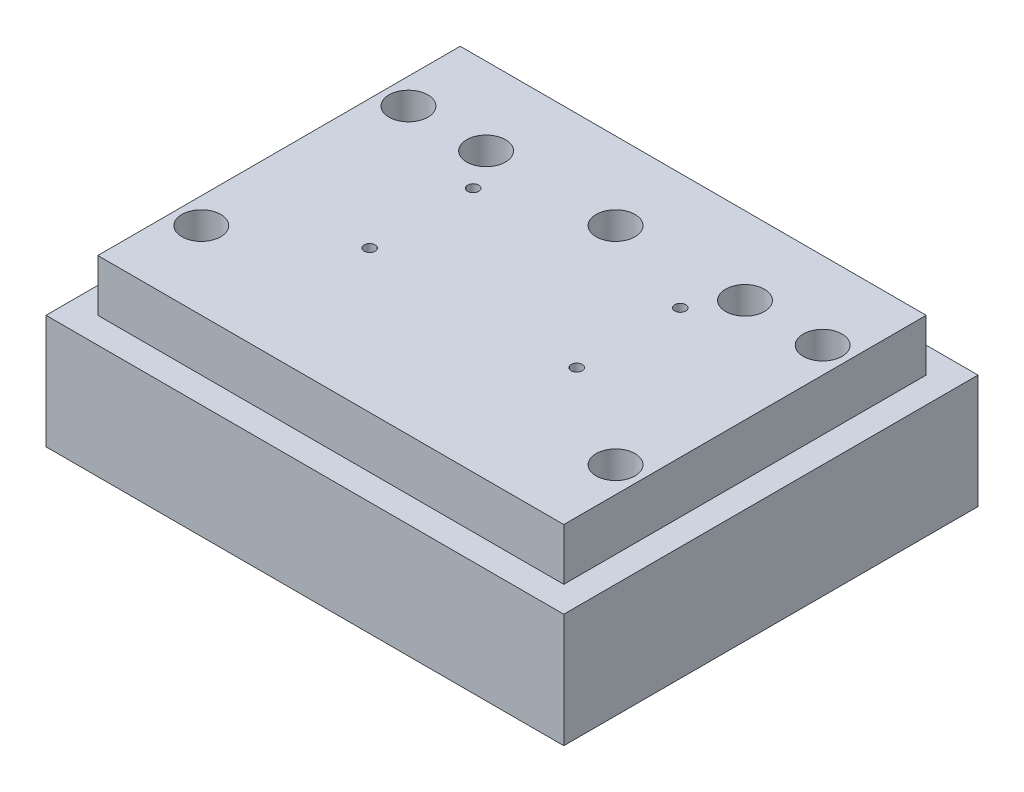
ISO-10303-21;
HEADER;
FILE_DESCRIPTION(('STEP AP214'),'2;1');
FILE_NAME('part.step','',(''),(''),'','','');
FILE_SCHEMA(('AUTOMOTIVE_DESIGN { 1 0 10303 214 1 1 1 1 }'));
ENDSEC;
DATA;
#1=APPLICATION_CONTEXT('core data for automotive mechanical design processes');
#2=APPLICATION_PROTOCOL_DEFINITION('international standard','automotive_design',2000,#1);
#3=PRODUCT_CONTEXT('',#1,'mechanical');
#4=PRODUCT('Part','Part','',(#3));
#5=PRODUCT_RELATED_PRODUCT_CATEGORY('part','',(#4));
#6=PRODUCT_DEFINITION_FORMATION('','',#4);
#7=PRODUCT_DEFINITION_CONTEXT('part definition',#1,'design');
#8=PRODUCT_DEFINITION('design','',#6,#7);
#9=PRODUCT_DEFINITION_SHAPE('','',#8);
#10=(LENGTH_UNIT() NAMED_UNIT(*) SI_UNIT(.MILLI.,.METRE.));
#11=(NAMED_UNIT(*) PLANE_ANGLE_UNIT() SI_UNIT($,.RADIAN.));
#12=(NAMED_UNIT(*) SI_UNIT($,.STERADIAN.) SOLID_ANGLE_UNIT());
#13=UNCERTAINTY_MEASURE_WITH_UNIT(LENGTH_MEASURE(1.E-05),#10,'distance_accuracy_value','');
#14=(GEOMETRIC_REPRESENTATION_CONTEXT(3) GLOBAL_UNCERTAINTY_ASSIGNED_CONTEXT((#13)) GLOBAL_UNIT_ASSIGNED_CONTEXT((#10,
#11,#12)) REPRESENTATION_CONTEXT('',''));
#15=CARTESIAN_POINT('',(0.,0.,0.));
#16=DIRECTION('',(0.,0.,1.));
#17=DIRECTION('',(1.,0.,0.));
#18=AXIS2_PLACEMENT_3D('',#15,#16,#17);
#19=CARTESIAN_POINT('',(-15.0464246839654,12.7,-20.7984109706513));
#20=DIRECTION('',(0.,0.,-1.));
#21=DIRECTION('',(-1.,0.,0.));
#22=AXIS2_PLACEMENT_3D('',#19,#20,#21);
#23=CYLINDRICAL_SURFACE('',#22,4.76249999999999);
#24=CARTESIAN_POINT('',(-15.0464246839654,12.7,4.6015890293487));
#25=DIRECTION('',(0.,0.707106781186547,0.707106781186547));
#26=DIRECTION('',(0.,0.707106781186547,-0.707106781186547));
#27=AXIS2_PLACEMENT_3D('',#24,#25,#26);
#28=ELLIPSE('',#27,6.73519209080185,4.76249999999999);
#29=CARTESIAN_POINT('',(-19.8089246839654,12.7,4.6015890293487));
#30=VERTEX_POINT('',#29);
#31=CARTESIAN_POINT('',(-10.2839246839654,12.7,4.6015890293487));
#32=VERTEX_POINT('',#31);
#33=EDGE_CURVE('E516',#30,#32,#28,.F.);
#34=ORIENTED_EDGE('',*,*,#33,.F.);
#35=CARTESIAN_POINT('',(-15.0464246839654,12.7,4.6015890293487));
#36=DIRECTION('',(0.,0.707106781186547,-0.707106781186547));
#37=DIRECTION('',(0.,0.707106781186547,0.707106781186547));
#38=AXIS2_PLACEMENT_3D('',#35,#36,#37);
#39=ELLIPSE('',#38,6.73519209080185,4.76249999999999);
#40=EDGE_CURVE('E573',#32,#30,#39,.T.);
#41=ORIENTED_EDGE('',*,*,#40,.F.);
#42=EDGE_LOOP('',(#34,#41));
#43=FACE_BOUND('',#42,.T.);
#44=CARTESIAN_POINT('',(-15.0464246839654,12.7,-8.0984109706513));
#45=DIRECTION('',(0.,0.,-1.));
#46=DIRECTION('',(-1.,0.,0.));
#47=AXIS2_PLACEMENT_3D('',#44,#45,#46);
#48=CIRCLE('',#47,4.76249999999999);
#49=CARTESIAN_POINT('',(-19.8089246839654,12.7,-8.0984109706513));
#50=VERTEX_POINT('',#49);
#51=EDGE_CURVE('E50',#50,#50,#48,.F.);
#52=ORIENTED_EDGE('',*,*,#51,.F.);
#53=EDGE_LOOP('',(#52));
#54=FACE_BOUND('',#53,.T.);
#55=ADVANCED_FACE('F46',(#43,#54),#23,.F.);
#56=CARTESIAN_POINT('',(48.4535753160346,12.7,-20.7984109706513));
#57=DIRECTION('',(0.,0.,-1.));
#58=DIRECTION('',(-1.,0.,0.));
#59=AXIS2_PLACEMENT_3D('',#56,#57,#58);
#60=CYLINDRICAL_SURFACE('',#59,4.76249999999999);
#61=CARTESIAN_POINT('',(48.4535753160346,12.7,4.60158902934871));
#62=DIRECTION('',(0.,0.707106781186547,0.707106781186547));
#63=DIRECTION('',(0.,0.707106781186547,-0.707106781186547));
#64=AXIS2_PLACEMENT_3D('',#61,#62,#63);
#65=ELLIPSE('',#64,6.73519209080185,4.76249999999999);
#66=CARTESIAN_POINT('',(43.6910753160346,12.7,4.6015890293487));
#67=VERTEX_POINT('',#66);
#68=CARTESIAN_POINT('',(53.2160753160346,12.7,4.6015890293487));
#69=VERTEX_POINT('',#68);
#70=EDGE_CURVE('E56',#67,#69,#65,.F.);
#71=ORIENTED_EDGE('',*,*,#70,.F.);
#72=CARTESIAN_POINT('',(48.4535753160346,12.7,4.60158902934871));
#73=DIRECTION('',(0.,0.707106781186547,-0.707106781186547));
#74=DIRECTION('',(0.,0.707106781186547,0.707106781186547));
#75=AXIS2_PLACEMENT_3D('',#72,#73,#74);
#76=ELLIPSE('',#75,6.73519209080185,4.76249999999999);
#77=EDGE_CURVE('E11',#69,#67,#76,.T.);
#78=ORIENTED_EDGE('',*,*,#77,.F.);
#79=EDGE_LOOP('',(#71,#78));
#80=FACE_BOUND('',#79,.T.);
#81=CARTESIAN_POINT('',(48.4535753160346,12.7,-8.0984109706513));
#82=DIRECTION('',(0.,0.,-1.));
#83=DIRECTION('',(-1.,0.,0.));
#84=AXIS2_PLACEMENT_3D('',#81,#82,#83);
#85=CIRCLE('',#84,4.76249999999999);
#86=CARTESIAN_POINT('',(43.6910753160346,12.7,-8.0984109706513));
#87=VERTEX_POINT('',#86);
#88=EDGE_CURVE('E286',#87,#87,#85,.F.);
#89=ORIENTED_EDGE('',*,*,#88,.F.);
#90=EDGE_LOOP('',(#89));
#91=FACE_BOUND('',#90,.T.);
#92=ADVANCED_FACE('F551',(#80,#91),#60,.F.);
#93=CARTESIAN_POINT('',(-46.7964246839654,27.94,-20.7984109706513));
#94=DIRECTION('',(1.,0.,0.));
#95=DIRECTION('',(0.,0.,-1.));
#96=AXIS2_PLACEMENT_3D('',#93,#94,#95);
#97=PLANE('',#96);
#98=DIRECTION('',(0.,0.,1.));
#99=VECTOR('',#98,1.);
#100=CARTESIAN_POINT('',(-46.7964246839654,0.,-20.7984109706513));
#101=LINE('',#100,#99);
#102=CARTESIAN_POINT('',(-46.7964246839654,0.,-20.7984109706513));
#103=VERTEX_POINT('',#102);
#104=CARTESIAN_POINT('',(-46.7964246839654,0.,80.8015890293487));
#105=VERTEX_POINT('',#104);
#106=EDGE_CURVE('E474',#103,#105,#101,.T.);
#107=ORIENTED_EDGE('',*,*,#106,.T.);
#108=DIRECTION('',(0.,-1.,0.));
#109=VECTOR('',#108,1.);
#110=CARTESIAN_POINT('',(-46.7964246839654,27.94,80.8015890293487));
#111=LINE('',#110,#109);
#112=CARTESIAN_POINT('',(-46.7964246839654,27.94,80.8015890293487));
#113=VERTEX_POINT('',#112);
#114=EDGE_CURVE('E512',#113,#105,#111,.T.);
#115=ORIENTED_EDGE('',*,*,#114,.F.);
#116=DIRECTION('',(0.,0.,1.));
#117=VECTOR('',#116,1.);
#118=CARTESIAN_POINT('',(-46.7964246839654,27.94,-20.7984109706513));
#119=LINE('',#118,#117);
#120=CARTESIAN_POINT('',(-46.7964246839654,27.94,-20.7984109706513));
#121=VERTEX_POINT('',#120);
#122=EDGE_CURVE('E475',#121,#113,#119,.T.);
#123=ORIENTED_EDGE('',*,*,#122,.F.);
#124=DIRECTION('',(0.,-1.,0.));
#125=VECTOR('',#124,1.);
#126=CARTESIAN_POINT('',(-46.7964246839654,27.94,-20.7984109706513));
#127=LINE('',#126,#125);
#128=EDGE_CURVE('E489',#121,#103,#127,.T.);
#129=ORIENTED_EDGE('',*,*,#128,.T.);
#130=EDGE_LOOP('',(#107,#115,#123,#129));
#131=FACE_BOUND('',#130,.T.);
#132=ADVANCED_FACE('F48',(#131),#97,.F.);
#133=CARTESIAN_POINT('',(-46.7964246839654,27.94,80.8015890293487));
#134=DIRECTION('',(0.,0.,-1.));
#135=DIRECTION('',(-1.,0.,0.));
#136=AXIS2_PLACEMENT_3D('',#133,#134,#135);
#137=PLANE('',#136);
#138=DIRECTION('',(1.,0.,0.));
#139=VECTOR('',#138,1.);
#140=CARTESIAN_POINT('',(-46.7964246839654,0.,80.8015890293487));
#141=LINE('',#140,#139);
#142=CARTESIAN_POINT('',(80.2035753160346,0.,80.8015890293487));
#143=VERTEX_POINT('',#142);
#144=EDGE_CURVE('E493',#105,#143,#141,.T.);
#145=ORIENTED_EDGE('',*,*,#144,.T.);
#146=DIRECTION('',(0.,-1.,0.));
#147=VECTOR('',#146,1.);
#148=CARTESIAN_POINT('',(80.2035753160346,27.94,80.8015890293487));
#149=LINE('',#148,#147);
#150=CARTESIAN_POINT('',(80.2035753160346,27.94,80.8015890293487));
#151=VERTEX_POINT('',#150);
#152=EDGE_CURVE('E508',#151,#143,#149,.T.);
#153=ORIENTED_EDGE('',*,*,#152,.F.);
#154=DIRECTION('',(1.,0.,0.));
#155=VECTOR('',#154,1.);
#156=CARTESIAN_POINT('',(-46.7964246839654,27.94,80.8015890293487));
#157=LINE('',#156,#155);
#158=EDGE_CURVE('E479',#113,#151,#157,.T.);
#159=ORIENTED_EDGE('',*,*,#158,.F.);
#160=ORIENTED_EDGE('',*,*,#114,.T.);
#161=EDGE_LOOP('',(#145,#153,#159,#160));
#162=FACE_BOUND('',#161,.T.);
#163=ADVANCED_FACE('F631',(#162),#137,.F.);
#164=CARTESIAN_POINT('',(80.2035753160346,27.94,-20.7984109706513));
#165=DIRECTION('',(-1.,0.,0.));
#166=DIRECTION('',(0.,0.,1.));
#167=AXIS2_PLACEMENT_3D('',#164,#165,#166);
#168=PLANE('',#167);
#169=DIRECTION('',(0.,0.,-1.));
#170=VECTOR('',#169,1.);
#171=CARTESIAN_POINT('',(80.2035753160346,0.,-20.7984109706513));
#172=LINE('',#171,#170);
#173=CARTESIAN_POINT('',(80.2035753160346,0.,-20.7984109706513));
#174=VERTEX_POINT('',#173);
#175=EDGE_CURVE('E496',#143,#174,#172,.T.);
#176=ORIENTED_EDGE('',*,*,#175,.T.);
#177=DIRECTION('',(0.,-1.,0.));
#178=VECTOR('',#177,1.);
#179=CARTESIAN_POINT('',(80.2035753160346,27.94,-20.7984109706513));
#180=LINE('',#179,#178);
#181=CARTESIAN_POINT('',(80.2035753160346,27.94,-20.7984109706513));
#182=VERTEX_POINT('',#181);
#183=EDGE_CURVE('E504',#182,#174,#180,.T.);
#184=ORIENTED_EDGE('',*,*,#183,.F.);
#185=DIRECTION('',(0.,0.,-1.));
#186=VECTOR('',#185,1.);
#187=CARTESIAN_POINT('',(80.2035753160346,27.94,-20.7984109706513));
#188=LINE('',#187,#186);
#189=EDGE_CURVE('E483',#151,#182,#188,.T.);
#190=ORIENTED_EDGE('',*,*,#189,.F.);
#191=ORIENTED_EDGE('',*,*,#152,.T.);
#192=EDGE_LOOP('',(#176,#184,#190,#191));
#193=FACE_BOUND('',#192,.T.);
#194=ADVANCED_FACE('F636',(#193),#168,.F.);
#195=CARTESIAN_POINT('',(-46.7964246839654,27.94,-20.7984109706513));
#196=DIRECTION('',(0.,0.,1.));
#197=DIRECTION('',(1.,0.,0.));
#198=AXIS2_PLACEMENT_3D('',#195,#196,#197);
#199=PLANE('',#198);
#200=CARTESIAN_POINT('',(65.1159753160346,12.7,-20.7984109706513));
#201=DIRECTION('',(0.,0.,-1.));
#202=DIRECTION('',(-1.,0.,0.));
#203=AXIS2_PLACEMENT_3D('',#200,#201,#202);
#204=CIRCLE('',#203,1.1303);
#205=CARTESIAN_POINT('',(63.9856753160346,12.7,-20.7984109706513));
#206=VERTEX_POINT('',#205);
#207=EDGE_CURVE('E221',#206,#206,#204,.T.);
#208=ORIENTED_EDGE('',*,*,#207,.F.);
#209=EDGE_LOOP('',(#208));
#210=FACE_BOUND('',#209,.T.);
#211=CARTESIAN_POINT('',(31.7911753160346,12.7,-20.7984109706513));
#212=DIRECTION('',(0.,0.,-1.));
#213=DIRECTION('',(-1.,0.,0.));
#214=AXIS2_PLACEMENT_3D('',#211,#212,#213);
#215=CIRCLE('',#214,1.1303);
#216=CARTESIAN_POINT('',(30.6608753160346,12.7,-20.7984109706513));
#217=VERTEX_POINT('',#216);
#218=EDGE_CURVE('E220',#217,#217,#215,.T.);
#219=ORIENTED_EDGE('',*,*,#218,.F.);
#220=EDGE_LOOP('',(#219));
#221=FACE_BOUND('',#220,.T.);
#222=CARTESIAN_POINT('',(-2.54962468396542,12.7,-20.7984109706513));
#223=DIRECTION('',(0.,0.,-1.));
#224=DIRECTION('',(-1.,0.,0.));
#225=AXIS2_PLACEMENT_3D('',#222,#223,#224);
#226=CIRCLE('',#225,1.1303);
#227=CARTESIAN_POINT('',(-3.67992468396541,12.7,-20.7984109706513));
#228=VERTEX_POINT('',#227);
#229=EDGE_CURVE('E235',#228,#228,#226,.T.);
#230=ORIENTED_EDGE('',*,*,#229,.F.);
#231=EDGE_LOOP('',(#230));
#232=FACE_BOUND('',#231,.T.);
#233=CARTESIAN_POINT('',(-27.5432246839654,12.7,-20.7984109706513));
#234=DIRECTION('',(0.,0.,-1.));
#235=DIRECTION('',(-1.,0.,0.));
#236=AXIS2_PLACEMENT_3D('',#233,#234,#235);
#237=CIRCLE('',#236,1.1303);
#238=CARTESIAN_POINT('',(-28.6735246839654,12.7,-20.7984109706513));
#239=VERTEX_POINT('',#238);
#240=EDGE_CURVE('E243',#239,#239,#237,.T.);
#241=ORIENTED_EDGE('',*,*,#240,.F.);
#242=EDGE_LOOP('',(#241));
#243=FACE_BOUND('',#242,.T.);
#244=DIRECTION('',(-1.,0.,0.));
#245=VECTOR('',#244,1.);
#246=CARTESIAN_POINT('',(63.0585753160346,6.985,-20.7984109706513));
#247=LINE('',#246,#245);
#248=CARTESIAN_POINT('',(63.0585753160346,6.985,-20.7984109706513));
#249=VERTEX_POINT('',#248);
#250=CARTESIAN_POINT('',(33.8485753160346,6.985,-20.7984109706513));
#251=VERTEX_POINT('',#250);
#252=EDGE_CURVE('E272',#249,#251,#247,.T.);
#253=ORIENTED_EDGE('',*,*,#252,.F.);
#254=DIRECTION('',(0.,-1.,0.));
#255=VECTOR('',#254,1.);
#256=CARTESIAN_POINT('',(63.0585753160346,18.415,-20.7984109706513));
#257=LINE('',#256,#255);
#258=CARTESIAN_POINT('',(63.0585753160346,18.415,-20.7984109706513));
#259=VERTEX_POINT('',#258);
#260=EDGE_CURVE('E64',#259,#249,#257,.T.);
#261=ORIENTED_EDGE('',*,*,#260,.F.);
#262=DIRECTION('',(1.,0.,0.));
#263=VECTOR('',#262,1.);
#264=CARTESIAN_POINT('',(63.0585753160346,18.415,-20.7984109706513));
#265=LINE('',#264,#263);
#266=CARTESIAN_POINT('',(33.8485753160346,18.415,-20.7984109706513));
#267=VERTEX_POINT('',#266);
#268=EDGE_CURVE('E257',#267,#259,#265,.T.);
#269=ORIENTED_EDGE('',*,*,#268,.F.);
#270=DIRECTION('',(0.,1.,0.));
#271=VECTOR('',#270,1.);
#272=CARTESIAN_POINT('',(33.8485753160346,18.415,-20.7984109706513));
#273=LINE('',#272,#271);
#274=EDGE_CURVE('E276',#251,#267,#273,.T.);
#275=ORIENTED_EDGE('',*,*,#274,.F.);
#276=EDGE_LOOP('',(#253,#261,#269,#275));
#277=FACE_BOUND('',#276,.T.);
#278=DIRECTION('',(-1.,0.,0.));
#279=VECTOR('',#278,1.);
#280=CARTESIAN_POINT('',(-4.63242468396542,6.985,-20.7984109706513));
#281=LINE('',#280,#279);
#282=CARTESIAN_POINT('',(-4.63242468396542,6.985,-20.7984109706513));
#283=VERTEX_POINT('',#282);
#284=CARTESIAN_POINT('',(-25.4604246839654,6.985,-20.7984109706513));
#285=VERTEX_POINT('',#284);
#286=EDGE_CURVE('E316',#283,#285,#281,.T.);
#287=ORIENTED_EDGE('',*,*,#286,.F.);
#288=DIRECTION('',(0.,-1.,0.));
#289=VECTOR('',#288,1.);
#290=CARTESIAN_POINT('',(-4.63242468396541,18.415,-20.7984109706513));
#291=LINE('',#290,#289);
#292=CARTESIAN_POINT('',(-4.63242468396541,18.415,-20.7984109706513));
#293=VERTEX_POINT('',#292);
#294=EDGE_CURVE('E72',#293,#283,#291,.T.);
#295=ORIENTED_EDGE('',*,*,#294,.F.);
#296=DIRECTION('',(1.,0.,0.));
#297=VECTOR('',#296,1.);
#298=CARTESIAN_POINT('',(-4.63242468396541,18.415,-20.7984109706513));
#299=LINE('',#298,#297);
#300=CARTESIAN_POINT('',(-25.4604246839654,18.415,-20.7984109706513));
#301=VERTEX_POINT('',#300);
#302=EDGE_CURVE('E307',#301,#293,#299,.T.);
#303=ORIENTED_EDGE('',*,*,#302,.F.);
#304=DIRECTION('',(0.,1.,0.));
#305=VECTOR('',#304,1.);
#306=CARTESIAN_POINT('',(-25.4604246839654,18.415,-20.7984109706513));
#307=LINE('',#306,#305);
#308=EDGE_CURVE('E311',#285,#301,#307,.T.);
#309=ORIENTED_EDGE('',*,*,#308,.F.);
#310=EDGE_LOOP('',(#287,#295,#303,#309));
#311=FACE_BOUND('',#310,.T.);
#312=CARTESIAN_POINT('',(16.7035753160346,12.7,-20.7984109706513));
#313=DIRECTION('',(0.,0.,-1.));
#314=DIRECTION('',(-1.,0.,0.));
#315=AXIS2_PLACEMENT_3D('',#312,#313,#314);
#316=CIRCLE('',#315,4.21639999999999);
#317=CARTESIAN_POINT('',(12.4871753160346,12.7,-20.7984109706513));
#318=VERTEX_POINT('',#317);
#319=EDGE_CURVE('E368',#318,#318,#316,.T.);
#320=ORIENTED_EDGE('',*,*,#319,.F.);
#321=EDGE_LOOP('',(#320));
#322=FACE_BOUND('',#321,.T.);
#323=DIRECTION('',(-1.,0.,0.));
#324=VECTOR('',#323,1.);
#325=CARTESIAN_POINT('',(-46.7964246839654,0.,-20.7984109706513));
#326=LINE('',#325,#324);
#327=EDGE_CURVE('E480',#174,#103,#326,.T.);
#328=ORIENTED_EDGE('',*,*,#327,.T.);
#329=ORIENTED_EDGE('',*,*,#128,.F.);
#330=DIRECTION('',(-1.,0.,0.));
#331=VECTOR('',#330,1.);
#332=CARTESIAN_POINT('',(-46.7964246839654,27.94,-20.7984109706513));
#333=LINE('',#332,#331);
#334=EDGE_CURVE('E486',#182,#121,#333,.T.);
#335=ORIENTED_EDGE('',*,*,#334,.F.);
#336=ORIENTED_EDGE('',*,*,#183,.T.);
#337=EDGE_LOOP('',(#328,#329,#335,#336));
#338=FACE_BOUND('',#337,.T.);
#339=ADVANCED_FACE('F621',(#210,#221,#232,#243,#277,#311,#322,#338),#199,.F.);
#340=CARTESIAN_POINT('',(0.,27.94,0.));
#341=DIRECTION('',(0.,1.,0.));
#342=DIRECTION('',(0.,0.,1.));
#343=AXIS2_PLACEMENT_3D('',#340,#341,#342);
#344=PLANE('',#343);
#345=DIRECTION('',(0.,0.,1.));
#346=VECTOR('',#345,1.);
#347=CARTESIAN_POINT('',(-40.4464246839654,27.94,-14.4484109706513));
#348=LINE('',#347,#346);
#349=CARTESIAN_POINT('',(-40.4464246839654,27.94,-14.4484109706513));
#350=VERTEX_POINT('',#349);
#351=CARTESIAN_POINT('',(-40.4464246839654,27.94,74.4515890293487));
#352=VERTEX_POINT('',#351);
#353=EDGE_CURVE('E429',#350,#352,#348,.T.);
#354=ORIENTED_EDGE('',*,*,#353,.F.);
#355=DIRECTION('',(-1.,0.,0.));
#356=VECTOR('',#355,1.);
#357=CARTESIAN_POINT('',(-40.4464246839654,27.94,-14.4484109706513));
#358=LINE('',#357,#356);
#359=CARTESIAN_POINT('',(73.8535753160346,27.94,-14.4484109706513));
#360=VERTEX_POINT('',#359);
#361=EDGE_CURVE('E435',#360,#350,#358,.T.);
#362=ORIENTED_EDGE('',*,*,#361,.F.);
#363=DIRECTION('',(0.,0.,-1.));
#364=VECTOR('',#363,1.);
#365=CARTESIAN_POINT('',(73.8535753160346,27.94,-14.4484109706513));
#366=LINE('',#365,#364);
#367=CARTESIAN_POINT('',(73.8535753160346,27.94,74.4515890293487));
#368=VERTEX_POINT('',#367);
#369=EDGE_CURVE('E452',#368,#360,#366,.T.);
#370=ORIENTED_EDGE('',*,*,#369,.F.);
#371=DIRECTION('',(1.,0.,0.));
#372=VECTOR('',#371,1.);
#373=CARTESIAN_POINT('',(-40.4464246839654,27.94,74.4515890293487));
#374=LINE('',#373,#372);
#375=EDGE_CURVE('E448',#352,#368,#374,.T.);
#376=ORIENTED_EDGE('',*,*,#375,.F.);
#377=EDGE_LOOP('',(#354,#362,#370,#376));
#378=FACE_BOUND('',#377,.T.);
#379=ORIENTED_EDGE('',*,*,#122,.T.);
#380=ORIENTED_EDGE('',*,*,#158,.T.);
#381=ORIENTED_EDGE('',*,*,#189,.T.);
#382=ORIENTED_EDGE('',*,*,#334,.T.);
#383=EDGE_LOOP('',(#379,#380,#381,#382));
#384=FACE_BOUND('',#383,.T.);
#385=ADVANCED_FACE('F617',(#378,#384),#344,.T.);
#386=CARTESIAN_POINT('',(0.,0.,0.));
#387=DIRECTION('',(0.,1.,0.));
#388=DIRECTION('',(0.,0.,1.));
#389=AXIS2_PLACEMENT_3D('',#386,#387,#388);
#390=PLANE('',#389);
#391=CARTESIAN_POINT('',(-34.0964246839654,0.,4.6015890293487));
#392=DIRECTION('',(0.,1.,0.));
#393=DIRECTION('',(0.,0.,1.));
#394=AXIS2_PLACEMENT_3D('',#391,#392,#393);
#395=CIRCLE('',#394,4.7625);
#396=CARTESIAN_POINT('',(-34.0964246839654,0.,9.3640890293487));
#397=VERTEX_POINT('',#396);
#398=EDGE_CURVE('E401',#397,#397,#395,.T.);
#399=ORIENTED_EDGE('',*,*,#398,.T.);
#400=EDGE_LOOP('',(#399));
#401=FACE_BOUND('',#400,.T.);
#402=CARTESIAN_POINT('',(67.5035753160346,0.,4.60158902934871));
#403=DIRECTION('',(0.,1.,0.));
#404=DIRECTION('',(0.,0.,1.));
#405=AXIS2_PLACEMENT_3D('',#402,#403,#404);
#406=CIRCLE('',#405,4.76249999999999);
#407=CARTESIAN_POINT('',(67.5035753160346,0.,9.3640890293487));
#408=VERTEX_POINT('',#407);
#409=EDGE_CURVE('E409',#408,#408,#406,.T.);
#410=ORIENTED_EDGE('',*,*,#409,.T.);
#411=EDGE_LOOP('',(#410));
#412=FACE_BOUND('',#411,.T.);
#413=CARTESIAN_POINT('',(-34.0964246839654,0.,55.4015890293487));
#414=DIRECTION('',(0.,1.,0.));
#415=DIRECTION('',(0.,0.,1.));
#416=AXIS2_PLACEMENT_3D('',#413,#414,#415);
#417=CIRCLE('',#416,4.7625);
#418=CARTESIAN_POINT('',(-34.0964246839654,0.,60.1640890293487));
#419=VERTEX_POINT('',#418);
#420=EDGE_CURVE('E417',#419,#419,#417,.T.);
#421=ORIENTED_EDGE('',*,*,#420,.T.);
#422=EDGE_LOOP('',(#421));
#423=FACE_BOUND('',#422,.T.);
#424=CARTESIAN_POINT('',(67.5035753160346,0.,55.4015890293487));
#425=DIRECTION('',(0.,1.,0.));
#426=DIRECTION('',(0.,0.,1.));
#427=AXIS2_PLACEMENT_3D('',#424,#425,#426);
#428=CIRCLE('',#427,4.76249999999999);
#429=CARTESIAN_POINT('',(67.5035753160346,0.,60.1640890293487));
#430=VERTEX_POINT('',#429);
#431=EDGE_CURVE('E425',#430,#430,#428,.T.);
#432=ORIENTED_EDGE('',*,*,#431,.T.);
#433=EDGE_LOOP('',(#432));
#434=FACE_BOUND('',#433,.T.);
#435=ORIENTED_EDGE('',*,*,#106,.F.);
#436=ORIENTED_EDGE('',*,*,#327,.F.);
#437=ORIENTED_EDGE('',*,*,#175,.F.);
#438=ORIENTED_EDGE('',*,*,#144,.F.);
#439=EDGE_LOOP('',(#435,#436,#437,#438));
#440=FACE_BOUND('',#439,.T.);
#441=ADVANCED_FACE('F620',(#401,#412,#423,#434,#440),#390,.F.);
#442=CARTESIAN_POINT('',(-40.4464246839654,40.64,-14.4484109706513));
#443=DIRECTION('',(1.,0.,0.));
#444=DIRECTION('',(0.,0.,-1.));
#445=AXIS2_PLACEMENT_3D('',#442,#443,#444);
#446=PLANE('',#445);
#447=ORIENTED_EDGE('',*,*,#353,.T.);
#448=DIRECTION('',(0.,-1.,0.));
#449=VECTOR('',#448,1.);
#450=CARTESIAN_POINT('',(-40.4464246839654,40.64,74.4515890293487));
#451=LINE('',#450,#449);
#452=CARTESIAN_POINT('',(-40.4464246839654,40.64,74.4515890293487));
#453=VERTEX_POINT('',#452);
#454=EDGE_CURVE('E470',#453,#352,#451,.T.);
#455=ORIENTED_EDGE('',*,*,#454,.F.);
#456=DIRECTION('',(0.,0.,1.));
#457=VECTOR('',#456,1.);
#458=CARTESIAN_POINT('',(-40.4464246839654,40.64,-14.4484109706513));
#459=LINE('',#458,#457);
#460=CARTESIAN_POINT('',(-40.4464246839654,40.64,-14.4484109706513));
#461=VERTEX_POINT('',#460);
#462=EDGE_CURVE('E430',#461,#453,#459,.T.);
#463=ORIENTED_EDGE('',*,*,#462,.F.);
#464=DIRECTION('',(0.,-1.,0.));
#465=VECTOR('',#464,1.);
#466=CARTESIAN_POINT('',(-40.4464246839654,40.64,-14.4484109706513));
#467=LINE('',#466,#465);
#468=EDGE_CURVE('E444',#461,#350,#467,.T.);
#469=ORIENTED_EDGE('',*,*,#468,.T.);
#470=EDGE_LOOP('',(#447,#455,#463,#469));
#471=FACE_BOUND('',#470,.T.);
#472=ADVANCED_FACE('F608',(#471),#446,.F.);
#473=CARTESIAN_POINT('',(-40.4464246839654,40.64,74.4515890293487));
#474=DIRECTION('',(0.,0.,-1.));
#475=DIRECTION('',(-1.,0.,0.));
#476=AXIS2_PLACEMENT_3D('',#473,#474,#475);
#477=PLANE('',#476);
#478=ORIENTED_EDGE('',*,*,#375,.T.);
#479=DIRECTION('',(0.,-1.,0.));
#480=VECTOR('',#479,1.);
#481=CARTESIAN_POINT('',(73.8535753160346,40.64,74.4515890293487));
#482=LINE('',#481,#480);
#483=CARTESIAN_POINT('',(73.8535753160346,40.64,74.4515890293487));
#484=VERTEX_POINT('',#483);
#485=EDGE_CURVE('E466',#484,#368,#482,.T.);
#486=ORIENTED_EDGE('',*,*,#485,.F.);
#487=DIRECTION('',(1.,0.,0.));
#488=VECTOR('',#487,1.);
#489=CARTESIAN_POINT('',(-40.4464246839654,40.64,74.4515890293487));
#490=LINE('',#489,#488);
#491=EDGE_CURVE('E434',#453,#484,#490,.T.);
#492=ORIENTED_EDGE('',*,*,#491,.F.);
#493=ORIENTED_EDGE('',*,*,#454,.T.);
#494=EDGE_LOOP('',(#478,#486,#492,#493));
#495=FACE_BOUND('',#494,.T.);
#496=ADVANCED_FACE('F610',(#495),#477,.F.);
#497=CARTESIAN_POINT('',(73.8535753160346,40.64,-14.4484109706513));
#498=DIRECTION('',(-1.,0.,0.));
#499=DIRECTION('',(0.,0.,1.));
#500=AXIS2_PLACEMENT_3D('',#497,#498,#499);
#501=PLANE('',#500);
#502=ORIENTED_EDGE('',*,*,#369,.T.);
#503=DIRECTION('',(0.,-1.,0.));
#504=VECTOR('',#503,1.);
#505=CARTESIAN_POINT('',(73.8535753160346,40.64,-14.4484109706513));
#506=LINE('',#505,#504);
#507=CARTESIAN_POINT('',(73.8535753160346,40.64,-14.4484109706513));
#508=VERTEX_POINT('',#507);
#509=EDGE_CURVE('E462',#508,#360,#506,.T.);
#510=ORIENTED_EDGE('',*,*,#509,.F.);
#511=DIRECTION('',(0.,0.,-1.));
#512=VECTOR('',#511,1.);
#513=CARTESIAN_POINT('',(73.8535753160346,40.64,-14.4484109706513));
#514=LINE('',#513,#512);
#515=EDGE_CURVE('E438',#484,#508,#514,.T.);
#516=ORIENTED_EDGE('',*,*,#515,.F.);
#517=ORIENTED_EDGE('',*,*,#485,.T.);
#518=EDGE_LOOP('',(#502,#510,#516,#517));
#519=FACE_BOUND('',#518,.T.);
#520=ADVANCED_FACE('F614',(#519),#501,.F.);
#521=CARTESIAN_POINT('',(-40.4464246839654,40.64,-14.4484109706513));
#522=DIRECTION('',(0.,0.,1.));
#523=DIRECTION('',(1.,0.,0.));
#524=AXIS2_PLACEMENT_3D('',#521,#522,#523);
#525=PLANE('',#524);
#526=ORIENTED_EDGE('',*,*,#361,.T.);
#527=ORIENTED_EDGE('',*,*,#468,.F.);
#528=DIRECTION('',(-1.,0.,0.));
#529=VECTOR('',#528,1.);
#530=CARTESIAN_POINT('',(-40.4464246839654,40.64,-14.4484109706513));
#531=LINE('',#530,#529);
#532=EDGE_CURVE('E441',#508,#461,#531,.T.);
#533=ORIENTED_EDGE('',*,*,#532,.F.);
#534=ORIENTED_EDGE('',*,*,#509,.T.);
#535=EDGE_LOOP('',(#526,#527,#533,#534));
#536=FACE_BOUND('',#535,.T.);
#537=ADVANCED_FACE('F587',(#536),#525,.F.);
#538=CARTESIAN_POINT('',(0.,40.64,0.));
#539=DIRECTION('',(0.,1.,0.));
#540=DIRECTION('',(0.,0.,1.));
#541=AXIS2_PLACEMENT_3D('',#538,#539,#540);
#542=PLANE('',#541);
#543=CARTESIAN_POINT('',(-8.69642468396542,40.64,14.1265890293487));
#544=DIRECTION('',(0.,1.,0.));
#545=DIRECTION('',(0.,0.,1.));
#546=AXIS2_PLACEMENT_3D('',#543,#544,#545);
#547=CIRCLE('',#546,1.35255);
#548=CARTESIAN_POINT('',(-8.69642468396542,40.64,15.4791390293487));
#549=VERTEX_POINT('',#548);
#550=EDGE_CURVE('E336',#549,#549,#547,.T.);
#551=ORIENTED_EDGE('',*,*,#550,.F.);
#552=EDGE_LOOP('',(#551));
#553=FACE_BOUND('',#552,.T.);
#554=CARTESIAN_POINT('',(42.1035753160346,40.64,14.1265890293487));
#555=DIRECTION('',(0.,1.,0.));
#556=DIRECTION('',(0.,0.,1.));
#557=AXIS2_PLACEMENT_3D('',#554,#555,#556);
#558=CIRCLE('',#557,1.35254999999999);
#559=CARTESIAN_POINT('',(42.1035753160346,40.64,15.4791390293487));
#560=VERTEX_POINT('',#559);
#561=EDGE_CURVE('E344',#560,#560,#558,.T.);
#562=ORIENTED_EDGE('',*,*,#561,.F.);
#563=EDGE_LOOP('',(#562));
#564=FACE_BOUND('',#563,.T.);
#565=CARTESIAN_POINT('',(42.1035753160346,40.64,39.5265890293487));
#566=DIRECTION('',(0.,1.,0.));
#567=DIRECTION('',(0.,0.,1.));
#568=AXIS2_PLACEMENT_3D('',#565,#566,#567);
#569=CIRCLE('',#568,1.35254999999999);
#570=CARTESIAN_POINT('',(42.1035753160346,40.64,40.8791390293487));
#571=VERTEX_POINT('',#570);
#572=EDGE_CURVE('E352',#571,#571,#569,.T.);
#573=ORIENTED_EDGE('',*,*,#572,.F.);
#574=EDGE_LOOP('',(#573));
#575=FACE_BOUND('',#574,.T.);
#576=CARTESIAN_POINT('',(-8.69642468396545,40.64,39.5265890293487));
#577=DIRECTION('',(0.,1.,0.));
#578=DIRECTION('',(0.,0.,1.));
#579=AXIS2_PLACEMENT_3D('',#576,#577,#578);
#580=CIRCLE('',#579,1.35255);
#581=CARTESIAN_POINT('',(-8.69642468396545,40.64,40.8791390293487));
#582=VERTEX_POINT('',#581);
#583=EDGE_CURVE('E360',#582,#582,#580,.T.);
#584=ORIENTED_EDGE('',*,*,#583,.F.);
#585=EDGE_LOOP('',(#584));
#586=FACE_BOUND('',#585,.T.);
#587=CARTESIAN_POINT('',(-15.0464246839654,40.64,4.6015890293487));
#588=DIRECTION('',(0.,1.,0.));
#589=DIRECTION('',(0.,0.,1.));
#590=AXIS2_PLACEMENT_3D('',#587,#588,#589);
#591=CIRCLE('',#590,4.76249999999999);
#592=CARTESIAN_POINT('',(-15.0464246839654,40.64,9.36408902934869));
#593=VERTEX_POINT('',#592);
#594=EDGE_CURVE('E373',#593,#593,#591,.T.);
#595=ORIENTED_EDGE('',*,*,#594,.F.);
#596=EDGE_LOOP('',(#595));
#597=FACE_BOUND('',#596,.T.);
#598=CARTESIAN_POINT('',(16.7035753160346,40.64,4.60158902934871));
#599=DIRECTION('',(0.,1.,0.));
#600=DIRECTION('',(0.,0.,1.));
#601=AXIS2_PLACEMENT_3D('',#598,#599,#600);
#602=CIRCLE('',#601,4.76249999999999);
#603=CARTESIAN_POINT('',(16.7035753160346,40.64,9.3640890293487));
#604=VERTEX_POINT('',#603);
#605=EDGE_CURVE('E381',#604,#604,#602,.T.);
#606=ORIENTED_EDGE('',*,*,#605,.F.);
#607=EDGE_LOOP('',(#606));
#608=FACE_BOUND('',#607,.T.);
#609=CARTESIAN_POINT('',(48.4535753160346,40.64,4.60158902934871));
#610=DIRECTION('',(0.,1.,0.));
#611=DIRECTION('',(0.,0.,1.));
#612=AXIS2_PLACEMENT_3D('',#609,#610,#611);
#613=CIRCLE('',#612,4.76249999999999);
#614=CARTESIAN_POINT('',(48.4535753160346,40.64,9.3640890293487));
#615=VERTEX_POINT('',#614);
#616=EDGE_CURVE('E389',#615,#615,#613,.T.);
#617=ORIENTED_EDGE('',*,*,#616,.F.);
#618=EDGE_LOOP('',(#617));
#619=FACE_BOUND('',#618,.T.);
#620=CARTESIAN_POINT('',(-34.0964246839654,40.64,4.6015890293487));
#621=DIRECTION('',(0.,1.,0.));
#622=DIRECTION('',(0.,0.,1.));
#623=AXIS2_PLACEMENT_3D('',#620,#621,#622);
#624=CIRCLE('',#623,4.7625);
#625=CARTESIAN_POINT('',(-34.0964246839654,40.64,9.3640890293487));
#626=VERTEX_POINT('',#625);
#627=EDGE_CURVE('E397',#626,#626,#624,.T.);
#628=ORIENTED_EDGE('',*,*,#627,.F.);
#629=EDGE_LOOP('',(#628));
#630=FACE_BOUND('',#629,.T.);
#631=CARTESIAN_POINT('',(67.5035753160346,40.64,4.60158902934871));
#632=DIRECTION('',(0.,1.,0.));
#633=DIRECTION('',(0.,0.,1.));
#634=AXIS2_PLACEMENT_3D('',#631,#632,#633);
#635=CIRCLE('',#634,4.7625);
#636=CARTESIAN_POINT('',(67.5035753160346,40.64,9.36408902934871));
#637=VERTEX_POINT('',#636);
#638=EDGE_CURVE('E405',#637,#637,#635,.T.);
#639=ORIENTED_EDGE('',*,*,#638,.F.);
#640=EDGE_LOOP('',(#639));
#641=FACE_BOUND('',#640,.T.);
#642=CARTESIAN_POINT('',(-34.0964246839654,40.64,55.4015890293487));
#643=DIRECTION('',(0.,1.,0.));
#644=DIRECTION('',(0.,0.,1.));
#645=AXIS2_PLACEMENT_3D('',#642,#643,#644);
#646=CIRCLE('',#645,4.7625);
#647=CARTESIAN_POINT('',(-34.0964246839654,40.64,60.1640890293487));
#648=VERTEX_POINT('',#647);
#649=EDGE_CURVE('E413',#648,#648,#646,.T.);
#650=ORIENTED_EDGE('',*,*,#649,.F.);
#651=EDGE_LOOP('',(#650));
#652=FACE_BOUND('',#651,.T.);
#653=CARTESIAN_POINT('',(67.5035753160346,40.64,55.4015890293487));
#654=DIRECTION('',(0.,1.,0.));
#655=DIRECTION('',(0.,0.,1.));
#656=AXIS2_PLACEMENT_3D('',#653,#654,#655);
#657=CIRCLE('',#656,4.7625);
#658=CARTESIAN_POINT('',(67.5035753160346,40.64,60.1640890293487));
#659=VERTEX_POINT('',#658);
#660=EDGE_CURVE('E421',#659,#659,#657,.T.);
#661=ORIENTED_EDGE('',*,*,#660,.F.);
#662=EDGE_LOOP('',(#661));
#663=FACE_BOUND('',#662,.T.);
#664=ORIENTED_EDGE('',*,*,#462,.T.);
#665=ORIENTED_EDGE('',*,*,#491,.T.);
#666=ORIENTED_EDGE('',*,*,#515,.T.);
#667=ORIENTED_EDGE('',*,*,#532,.T.);
#668=EDGE_LOOP('',(#664,#665,#666,#667));
#669=FACE_BOUND('',#668,.T.);
#670=ADVANCED_FACE('F583',(#553,#564,#575,#586,#597,#608,#619,#630,#641,#652,#663,#669),#542,.T.);
#671=CARTESIAN_POINT('',(67.5035753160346,40.64,55.4015890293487));
#672=DIRECTION('',(0.,1.,0.));
#673=DIRECTION('',(0.,0.,1.));
#674=AXIS2_PLACEMENT_3D('',#671,#672,#673);
#675=CYLINDRICAL_SURFACE('',#674,4.7625);
#676=ORIENTED_EDGE('',*,*,#431,.F.);
#677=EDGE_LOOP('',(#676));
#678=FACE_BOUND('',#677,.T.);
#679=ORIENTED_EDGE('',*,*,#660,.T.);
#680=EDGE_LOOP('',(#679));
#681=FACE_BOUND('',#680,.T.);
#682=ADVANCED_FACE('F586',(#678,#681),#675,.F.);
#683=CARTESIAN_POINT('',(-34.0964246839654,40.64,55.4015890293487));
#684=DIRECTION('',(0.,1.,0.));
#685=DIRECTION('',(0.,0.,1.));
#686=AXIS2_PLACEMENT_3D('',#683,#684,#685);
#687=CYLINDRICAL_SURFACE('',#686,4.7625);
#688=ORIENTED_EDGE('',*,*,#420,.F.);
#689=EDGE_LOOP('',(#688));
#690=FACE_BOUND('',#689,.T.);
#691=ORIENTED_EDGE('',*,*,#649,.T.);
#692=EDGE_LOOP('',(#691));
#693=FACE_BOUND('',#692,.T.);
#694=ADVANCED_FACE('F963',(#690,#693),#687,.F.);
#695=CARTESIAN_POINT('',(67.5035753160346,40.64,4.60158902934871));
#696=DIRECTION('',(0.,1.,0.));
#697=DIRECTION('',(0.,0.,1.));
#698=AXIS2_PLACEMENT_3D('',#695,#696,#697);
#699=CYLINDRICAL_SURFACE('',#698,4.7625);
#700=ORIENTED_EDGE('',*,*,#409,.F.);
#701=EDGE_LOOP('',(#700));
#702=FACE_BOUND('',#701,.T.);
#703=ORIENTED_EDGE('',*,*,#638,.T.);
#704=EDGE_LOOP('',(#703));
#705=FACE_BOUND('',#704,.T.);
#706=ADVANCED_FACE('F971',(#702,#705),#699,.F.);
#707=CARTESIAN_POINT('',(-34.0964246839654,40.64,4.6015890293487));
#708=DIRECTION('',(0.,1.,0.));
#709=DIRECTION('',(0.,0.,1.));
#710=AXIS2_PLACEMENT_3D('',#707,#708,#709);
#711=CYLINDRICAL_SURFACE('',#710,4.7625);
#712=ORIENTED_EDGE('',*,*,#398,.F.);
#713=EDGE_LOOP('',(#712));
#714=FACE_BOUND('',#713,.T.);
#715=ORIENTED_EDGE('',*,*,#627,.T.);
#716=EDGE_LOOP('',(#715));
#717=FACE_BOUND('',#716,.T.);
#718=ADVANCED_FACE('F979',(#714,#717),#711,.F.);
#719=CARTESIAN_POINT('',(48.4535753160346,7.62,4.60158902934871));
#720=DIRECTION('',(0.,1.,0.));
#721=DIRECTION('',(0.,0.,1.));
#722=AXIS2_PLACEMENT_3D('',#719,#720,#721);
#723=CONICAL_SURFACE('',#722,4.76249999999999,1.02974425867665);
#724=CARTESIAN_POINT('',(48.4535753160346,4.75840130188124,4.60158902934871));
#725=VERTEX_POINT('',#724);
#726=VERTEX_LOOP('',#725);
#727=FACE_BOUND('',#726,.T.);
#728=CARTESIAN_POINT('',(48.4535753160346,7.62,4.60158902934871));
#729=DIRECTION('',(0.,1.,0.));
#730=DIRECTION('',(0.,0.,1.));
#731=AXIS2_PLACEMENT_3D('',#728,#729,#730);
#732=CIRCLE('',#731,4.76249999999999);
#733=CARTESIAN_POINT('',(48.4535753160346,7.62,9.3640890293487));
#734=VERTEX_POINT('',#733);
#735=EDGE_CURVE('E393',#734,#734,#732,.T.);
#736=ORIENTED_EDGE('',*,*,#735,.T.);
#737=EDGE_LOOP('',(#736));
#738=FACE_BOUND('',#737,.T.);
#739=ADVANCED_FACE('F987',(#727,#738),#723,.F.);
#740=CARTESIAN_POINT('',(48.4535753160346,40.64,4.60158902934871));
#741=DIRECTION('',(0.,1.,0.));
#742=DIRECTION('',(0.,0.,1.));
#743=AXIS2_PLACEMENT_3D('',#740,#741,#742);
#744=CYLINDRICAL_SURFACE('',#743,4.76249999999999);
#745=ORIENTED_EDGE('',*,*,#70,.T.);
#746=ORIENTED_EDGE('',*,*,#77,.T.);
#747=EDGE_LOOP('',(#745,#746));
#748=FACE_BOUND('',#747,.T.);
#749=ORIENTED_EDGE('',*,*,#735,.F.);
#750=EDGE_LOOP('',(#749));
#751=FACE_BOUND('',#750,.T.);
#752=ORIENTED_EDGE('',*,*,#616,.T.);
#753=EDGE_LOOP('',(#752));
#754=FACE_BOUND('',#753,.T.);
#755=ADVANCED_FACE('F995',(#748,#751,#754),#744,.F.);
#756=CARTESIAN_POINT('',(16.7035753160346,7.62,4.60158902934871));
#757=DIRECTION('',(0.,1.,0.));
#758=DIRECTION('',(0.,0.,1.));
#759=AXIS2_PLACEMENT_3D('',#756,#757,#758);
#760=CONICAL_SURFACE('',#759,4.76249999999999,1.02974425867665);
#761=CARTESIAN_POINT('',(16.7035753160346,4.75840130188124,4.60158902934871));
#762=VERTEX_POINT('',#761);
#763=VERTEX_LOOP('',#762);
#764=FACE_BOUND('',#763,.T.);
#765=CARTESIAN_POINT('',(16.7035753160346,7.62,4.60158902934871));
#766=DIRECTION('',(0.,1.,0.));
#767=DIRECTION('',(0.,0.,1.));
#768=AXIS2_PLACEMENT_3D('',#765,#766,#767);
#769=CIRCLE('',#768,4.76249999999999);
#770=CARTESIAN_POINT('',(16.7035753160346,7.62,9.3640890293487));
#771=VERTEX_POINT('',#770);
#772=EDGE_CURVE('E385',#771,#771,#769,.T.);
#773=ORIENTED_EDGE('',*,*,#772,.T.);
#774=EDGE_LOOP('',(#773));
#775=FACE_BOUND('',#774,.T.);
#776=ADVANCED_FACE('F547',(#764,#775),#760,.F.);
#777=CARTESIAN_POINT('',(16.7035753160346,40.64,4.60158902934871));
#778=DIRECTION('',(0.,1.,0.));
#779=DIRECTION('',(0.,0.,1.));
#780=AXIS2_PLACEMENT_3D('',#777,#778,#779);
#781=CYLINDRICAL_SURFACE('',#780,4.76249999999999);
#782=CARTESIAN_POINT('',(12.4871753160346,12.7,2.38723194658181));
#783=CARTESIAN_POINT('',(12.4871738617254,12.7660040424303,2.38723667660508));
#784=CARTESIAN_POINT('',(12.488729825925,12.8319928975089,2.38426443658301));
#785=CARTESIAN_POINT('',(12.4948918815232,12.9633250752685,2.37259093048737));
#786=CARTESIAN_POINT('',(12.4994989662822,13.0286681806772,2.3638877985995));
#787=CARTESIAN_POINT('',(12.5177371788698,13.2231954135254,2.32984015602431));
#788=CARTESIAN_POINT('',(12.5357844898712,13.3506266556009,2.29656037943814));
#789=CARTESIAN_POINT('',(12.5757672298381,13.5647167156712,2.22592964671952));
#790=CARTESIAN_POINT('',(12.5953361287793,13.6530921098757,2.19210576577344));
#791=CARTESIAN_POINT('',(12.6393680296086,13.8261468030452,2.11855314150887));
#792=CARTESIAN_POINT('',(12.663834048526,13.9108237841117,2.07882076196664));
#793=CARTESIAN_POINT('',(12.717350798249,14.0768371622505,1.99507876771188));
#794=CARTESIAN_POINT('',(12.746415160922,14.1581626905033,1.95105658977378));
#795=CARTESIAN_POINT('',(12.8088363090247,14.3175153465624,1.86015479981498));
#796=CARTESIAN_POINT('',(12.8421944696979,14.3955414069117,1.81327427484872));
#797=CARTESIAN_POINT('',(12.9355873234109,14.5971928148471,1.68729315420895));
#798=CARTESIAN_POINT('',(12.9990968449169,14.7182641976,1.60666045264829));
#799=CARTESIAN_POINT('',(13.1369557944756,14.9529475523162,1.44373295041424));
#800=CARTESIAN_POINT('',(13.2113114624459,15.0665551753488,1.36143721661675));
#801=CARTESIAN_POINT('',(13.3707921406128,15.286307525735,1.19761877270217));
#802=CARTESIAN_POINT('',(13.4559049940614,15.3924604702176,1.11609529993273));
#803=CARTESIAN_POINT('',(13.6370339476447,15.5970696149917,0.955718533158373));
#804=CARTESIAN_POINT('',(13.7330449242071,15.6955293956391,0.876864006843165));
#805=CARTESIAN_POINT('',(13.9898875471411,15.9340084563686,0.683030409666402));
#806=CARTESIAN_POINT('',(14.158183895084,16.0685318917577,0.570953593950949));
#807=CARTESIAN_POINT('',(14.5204251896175,16.3138037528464,0.363819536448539));
#808=CARTESIAN_POINT('',(14.7143255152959,16.4245926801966,0.26873334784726));
#809=CARTESIAN_POINT('',(15.0866220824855,16.5983551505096,0.118393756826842));
#810=CARTESIAN_POINT('',(15.2609178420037,16.6664186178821,0.0590018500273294));
#811=CARTESIAN_POINT('',(15.5316497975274,16.7513705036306,-0.015422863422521));
#812=CARTESIAN_POINT('',(15.6234683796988,16.7768352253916,-0.0377913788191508));
#813=CARTESIAN_POINT('',(15.8096792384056,16.821666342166,-0.0772351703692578));
#814=CARTESIAN_POINT('',(15.904070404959,16.8410353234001,-0.0943126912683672));
#815=CARTESIAN_POINT('',(16.0953710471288,16.873438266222,-0.122911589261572));
#816=CARTESIAN_POINT('',(16.1922923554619,16.8864329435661,-0.134398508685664));
#817=CARTESIAN_POINT('',(16.3872837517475,16.9056607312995,-0.151403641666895));
#818=CARTESIAN_POINT('',(16.4853533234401,16.9118967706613,-0.15692444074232));
#819=CARTESIAN_POINT('',(16.681850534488,16.917488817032,-0.161874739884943));
#820=CARTESIAN_POINT('',(16.7802781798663,16.9168447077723,-0.161304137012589));
#821=CARTESIAN_POINT('',(16.9765953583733,16.9087003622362,-0.154095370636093));
#822=CARTESIAN_POINT('',(17.0744849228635,16.9012005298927,-0.147457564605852));
#823=CARTESIAN_POINT('',(17.348579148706,16.8705591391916,-0.120364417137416));
#824=CARTESIAN_POINT('',(17.5233326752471,16.8396404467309,-0.09304739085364));
#825=CARTESIAN_POINT('',(17.863969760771,16.7573782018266,-0.0206744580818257));
#826=CARTESIAN_POINT('',(18.0298510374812,16.7060294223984,0.0243859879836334));
#827=CARTESIAN_POINT('',(18.3599905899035,16.5816689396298,0.132837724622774));
#828=CARTESIAN_POINT('',(18.5234851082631,16.507494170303,0.197206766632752));
#829=CARTESIAN_POINT('',(18.8351709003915,16.3421850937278,0.339297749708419));
#830=CARTESIAN_POINT('',(18.9833593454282,16.2510476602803,0.417022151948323));
#831=CARTESIAN_POINT('',(19.3369277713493,16.0032338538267,0.625652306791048));
#832=CARTESIAN_POINT('',(19.5319073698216,15.8371418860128,0.763175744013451));
#833=CARTESIAN_POINT('',(19.7968092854,15.5680844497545,0.978547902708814));
#834=CARTESIAN_POINT('',(19.8807145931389,15.4747843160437,1.05207561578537));
#835=CARTESIAN_POINT('',(20.0393564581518,15.281892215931,1.2007432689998));
#836=CARTESIAN_POINT('',(20.1140966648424,15.1823027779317,1.27588255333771));
#837=CARTESIAN_POINT('',(20.2561496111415,14.9745264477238,1.42799322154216));
#838=CARTESIAN_POINT('',(20.3232438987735,14.8661915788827,1.5049657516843));
#839=CARTESIAN_POINT('',(20.4479422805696,14.6427129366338,1.65697026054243));
#840=CARTESIAN_POINT('',(20.5055387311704,14.5275637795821,1.73200063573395));
#841=CARTESIAN_POINT('',(20.6106116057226,14.2905409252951,1.87680981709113));
#842=CARTESIAN_POINT('',(20.6581422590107,14.1687079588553,1.9466153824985));
#843=CARTESIAN_POINT('',(20.7427147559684,13.916952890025,2.07715311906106));
#844=CARTESIAN_POINT('',(20.7797772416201,13.7870473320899,2.13790303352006));
#845=CARTESIAN_POINT('',(20.8374201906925,13.5384884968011,2.23611003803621));
#846=CARTESIAN_POINT('',(20.8596424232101,13.421087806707,2.27569735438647));
#847=CARTESIAN_POINT('',(20.8942211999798,13.1807851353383,2.33858028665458));
#848=CARTESIAN_POINT('',(20.9066104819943,13.0579028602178,2.3619299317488));
#849=CARTESIAN_POINT('',(20.9204621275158,12.8079620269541,2.38809869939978));
#850=CARTESIAN_POINT('',(20.9218147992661,12.6808741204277,2.39071171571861));
#851=CARTESIAN_POINT('',(20.9131236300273,12.4284217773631,2.37422144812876));
#852=CARTESIAN_POINT('',(20.9030609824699,12.3030605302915,2.35508232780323));
#853=CARTESIAN_POINT('',(20.8689102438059,12.027908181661,2.29228220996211));
#854=CARTESIAN_POINT('',(20.8419953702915,11.8796345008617,2.24377123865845));
#855=CARTESIAN_POINT('',(20.7747445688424,11.5929941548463,2.12947222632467));
#856=CARTESIAN_POINT('',(20.734358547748,11.4546668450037,2.06361989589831));
#857=CARTESIAN_POINT('',(20.6464500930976,11.2006838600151,1.92933110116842));
#858=CARTESIAN_POINT('',(20.6000395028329,11.0841424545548,1.861805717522));
#859=CARTESIAN_POINT('',(20.4982195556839,10.8576836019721,1.72243327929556));
#860=CARTESIAN_POINT('',(20.442803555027,10.7477711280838,1.65058305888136));
#861=CARTESIAN_POINT('',(20.3231384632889,10.5339397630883,1.50496617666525));
#862=CARTESIAN_POINT('',(20.2588765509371,10.4300298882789,1.4311968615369));
#863=CARTESIAN_POINT('',(20.1216231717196,10.2281858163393,1.28368192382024));
#864=CARTESIAN_POINT('',(20.0486340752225,10.1302500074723,1.20993630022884));
#865=CARTESIAN_POINT('',(19.8890923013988,9.93460688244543,1.05946588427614));
#866=CARTESIAN_POINT('',(19.8019832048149,9.83727958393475,0.982834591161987));
#867=CARTESIAN_POINT('',(19.6176713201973,9.64986046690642,0.832825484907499));
#868=CARTESIAN_POINT('',(19.5204662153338,9.55977031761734,0.759448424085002));
#869=CARTESIAN_POINT('',(19.3161749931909,9.38788528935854,0.617730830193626));
#870=CARTESIAN_POINT('',(19.2091189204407,9.30606668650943,0.549376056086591));
#871=CARTESIAN_POINT('',(18.9850214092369,9.15153851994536,0.419097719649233));
#872=CARTESIAN_POINT('',(18.8679813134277,9.07882773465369,0.357173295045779));
#873=CARTESIAN_POINT('',(18.5829245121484,8.92101572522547,0.221870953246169));
#874=CARTESIAN_POINT('',(18.4110223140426,8.83999857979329,0.151667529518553));
#875=CARTESIAN_POINT('',(18.141994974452,8.73537222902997,0.0605137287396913));
#876=CARTESIAN_POINT('',(18.0504349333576,8.70330801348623,0.0324829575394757));
#877=CARTESIAN_POINT('',(17.8640184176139,8.6452605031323,-0.0183776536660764));
#878=CARTESIAN_POINT('',(17.769163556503,8.61927427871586,-0.0412099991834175));
#879=CARTESIAN_POINT('',(17.5759778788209,8.57363682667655,-0.0813728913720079));
#880=CARTESIAN_POINT('',(17.4776256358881,8.55403688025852,-0.0986588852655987));
#881=CARTESIAN_POINT('',(17.2789485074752,8.5218312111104,-0.127090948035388));
#882=CARTESIAN_POINT('',(17.1786245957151,8.5092221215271,-0.138239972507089));
#883=CARTESIAN_POINT('',(16.9768410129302,8.49124571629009,-0.154141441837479));
#884=CARTESIAN_POINT('',(16.8753815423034,8.48587714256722,-0.158894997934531));
#885=CARTESIAN_POINT('',(16.6722499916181,8.48249306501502,-0.161890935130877));
#886=CARTESIAN_POINT('',(16.5705779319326,8.48447688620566,-0.160133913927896));
#887=CARTESIAN_POINT('',(16.3791157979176,8.49513276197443,-0.150703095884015));
#888=CARTESIAN_POINT('',(16.2892490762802,8.50304501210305,-0.143701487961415));
#889=CARTESIAN_POINT('',(16.1107158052,8.52451850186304,-0.12472020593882));
#890=CARTESIAN_POINT('',(16.0220496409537,8.53808151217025,-0.112738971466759));
#891=CARTESIAN_POINT('',(15.7588064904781,8.58694721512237,-0.0696352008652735));
#892=CARTESIAN_POINT('',(15.5868214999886,8.63043617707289,-0.0313440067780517));
#893=CARTESIAN_POINT('',(15.2497512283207,8.7381089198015,0.062947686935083));
#894=CARTESIAN_POINT('',(15.0849431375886,8.80277954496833,0.119364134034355));
#895=CARTESIAN_POINT('',(14.7691696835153,8.94947319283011,0.246305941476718));
#896=CARTESIAN_POINT('',(14.6182101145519,9.03150343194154,0.316837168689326));
#897=CARTESIAN_POINT('',(14.2607146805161,9.25413252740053,0.506180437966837));
#898=CARTESIAN_POINT('',(14.0632524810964,9.40372019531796,0.631701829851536));
#899=CARTESIAN_POINT('',(13.7925563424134,9.64732316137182,0.830641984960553));
#900=CARTESIAN_POINT('',(13.7064343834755,9.73190711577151,0.89887177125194));
#901=CARTESIAN_POINT('',(13.5425835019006,9.90705852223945,1.03773721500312));
#902=CARTESIAN_POINT('',(13.4648532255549,9.99762500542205,1.10837248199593));
#903=CARTESIAN_POINT('',(13.3161178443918,10.1864505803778,1.25233711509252));
#904=CARTESIAN_POINT('',(13.2452962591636,10.2848343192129,1.32569164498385));
#905=CARTESIAN_POINT('',(13.1122433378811,10.4875204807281,1.47212855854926));
#906=CARTESIAN_POINT('',(13.0500152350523,10.5918251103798,1.54521082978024));
#907=CARTESIAN_POINT('',(12.9343435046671,10.8063907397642,1.68906568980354));
#908=CARTESIAN_POINT('',(12.8808835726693,10.9166401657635,1.75984236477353));
#909=CARTESIAN_POINT('',(12.7829189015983,11.1437977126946,1.89660834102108));
#910=CARTESIAN_POINT('',(12.7384061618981,11.2606997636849,1.96260188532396));
#911=CARTESIAN_POINT('',(12.6580211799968,11.5048292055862,2.08752472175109));
#912=CARTESIAN_POINT('',(12.6223667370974,11.632230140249,2.14626085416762));
#913=CARTESIAN_POINT('',(12.5624812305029,11.8953768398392,2.24865726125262));
#914=CARTESIAN_POINT('',(12.5382107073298,12.0310919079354,2.29236946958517));
#915=CARTESIAN_POINT('',(12.5096421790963,12.2566670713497,2.34485245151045));
#916=CARTESIAN_POINT('',(12.501259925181,12.3443787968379,2.36058819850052));
#917=CARTESIAN_POINT('',(12.490029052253,12.5214035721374,2.38177181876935));
#918=CARTESIAN_POINT('',(12.487177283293,12.6107156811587,2.38722554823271));
#919=CARTESIAN_POINT('',(12.4871753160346,12.7,2.38723194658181));
#920=B_SPLINE_CURVE_WITH_KNOTS('',3,(#782,#783,#784,#785,#786,#787,#788,#789,#790,#791,#792,
#793,#794,#795,#796,#797,#798,#799,#800,#801,#802,#803,#804,#805,#806,#807,#808,#809,#810,#811,
#812,#813,#814,#815,#816,#817,#818,#819,#820,#821,#822,#823,#824,#825,#826,#827,#828,#829,#830,
#831,#832,#833,#834,#835,#836,#837,#838,#839,#840,#841,#842,#843,#844,#845,#846,#847,#848,#849,
#850,#851,#852,#853,#854,#855,#856,#857,#858,#859,#860,#861,#862,#863,#864,#865,#866,#867,#868,
#869,#870,#871,#872,#873,#874,#875,#876,#877,#878,#879,#880,#881,#882,#883,#884,#885,#886,#887,
#888,#889,#890,#891,#892,#893,#894,#895,#896,#897,#898,#899,#900,#901,#902,#903,#904,#905,#906,
#907,#908,#909,#910,#911,#912,#913,#914,#915,#916,#917,#918,#919),.UNSPECIFIED.,.T.,.F.,(4,2,2,
2,2,2,2,2,2,2,2,2,2,2,2,2,2,2,2,2,2,2,2,2,2,2,2,2,2,2,2,2,2,2,2,2,2,2,2,2,2,2,2,2,2,2,2,2,2,2,2,
2,2,2,2,2,2,2,2,2,2,2,2,2,2,2,2,2,4),(0.,0.197898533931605,0.395861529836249,0.792527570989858,
1.08206209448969,1.37177554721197,1.6623645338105,1.95304682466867,2.42856989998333,
2.90436763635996,3.37963240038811,3.85467464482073,4.58046495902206,5.30500670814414,
5.89130849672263,6.18462085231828,6.47780859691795,6.77278121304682,7.06762594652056,
7.3624756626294,7.6573080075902,8.19335869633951,8.72954662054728,9.29958871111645,
9.86973596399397,10.7367700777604,11.1727777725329,11.608611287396,12.0547915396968,
12.5013291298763,12.9453960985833,13.3885812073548,13.7650087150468,14.1401776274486,
14.5190708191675,14.8985891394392,15.3708625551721,15.8449120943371,16.2717331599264,
16.6988705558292,17.1266336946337,17.5542809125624,18.0080728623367,18.4619691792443,
18.9145243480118,19.3670187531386,19.9720280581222,20.2746693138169,20.577164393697,
20.882031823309,21.1867522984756,21.4914198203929,21.796059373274,22.0671845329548,
22.3383947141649,22.8803296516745,23.4357151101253,23.9913318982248,24.8195654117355,
25.2352673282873,25.6509020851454,26.0755964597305,26.5004501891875,26.9245047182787,
27.3481783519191,27.781418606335,28.2131458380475,28.4809977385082,28.7486970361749),.UNSPECIFIED.);
#921=CARTESIAN_POINT('',(12.4871753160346,12.7,2.38723194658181));
#922=VERTEX_POINT('',#921);
#923=EDGE_CURVE('E372',#922,#922,#920,.T.);
#924=ORIENTED_EDGE('',*,*,#923,.T.);
#925=EDGE_LOOP('',(#924));
#926=FACE_BOUND('',#925,.T.);
#927=ORIENTED_EDGE('',*,*,#772,.F.);
#928=EDGE_LOOP('',(#927));
#929=FACE_BOUND('',#928,.T.);
#930=ORIENTED_EDGE('',*,*,#605,.T.);
#931=EDGE_LOOP('',(#930));
#932=FACE_BOUND('',#931,.T.);
#933=ADVANCED_FACE('F526',(#926,#929,#932),#781,.F.);
#934=CARTESIAN_POINT('',(-15.0464246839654,7.62,4.6015890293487));
#935=DIRECTION('',(0.,1.,0.));
#936=DIRECTION('',(0.,0.,1.));
#937=AXIS2_PLACEMENT_3D('',#934,#935,#936);
#938=CONICAL_SURFACE('',#937,4.76249999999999,1.02974425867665);
#939=CARTESIAN_POINT('',(-15.0464246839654,4.75840130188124,4.6015890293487));
#940=VERTEX_POINT('',#939);
#941=VERTEX_LOOP('',#940);
#942=FACE_BOUND('',#941,.T.);
#943=CARTESIAN_POINT('',(-15.0464246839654,7.62,4.6015890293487));
#944=DIRECTION('',(0.,1.,0.));
#945=DIRECTION('',(0.,0.,1.));
#946=AXIS2_PLACEMENT_3D('',#943,#944,#945);
#947=CIRCLE('',#946,4.76249999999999);
#948=CARTESIAN_POINT('',(-15.0464246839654,7.62,9.36408902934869));
#949=VERTEX_POINT('',#948);
#950=EDGE_CURVE('E377',#949,#949,#947,.T.);
#951=ORIENTED_EDGE('',*,*,#950,.T.);
#952=EDGE_LOOP('',(#951));
#953=FACE_BOUND('',#952,.T.);
#954=ADVANCED_FACE('F540',(#942,#953),#938,.F.);
#955=CARTESIAN_POINT('',(-15.0464246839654,40.64,4.6015890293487));
#956=DIRECTION('',(0.,1.,0.));
#957=DIRECTION('',(0.,0.,1.));
#958=AXIS2_PLACEMENT_3D('',#955,#956,#957);
#959=CYLINDRICAL_SURFACE('',#958,4.76249999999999);
#960=ORIENTED_EDGE('',*,*,#33,.T.);
#961=ORIENTED_EDGE('',*,*,#40,.T.);
#962=EDGE_LOOP('',(#960,#961));
#963=FACE_BOUND('',#962,.T.);
#964=ORIENTED_EDGE('',*,*,#950,.F.);
#965=EDGE_LOOP('',(#964));
#966=FACE_BOUND('',#965,.T.);
#967=ORIENTED_EDGE('',*,*,#594,.T.);
#968=EDGE_LOOP('',(#967));
#969=FACE_BOUND('',#968,.T.);
#970=ADVANCED_FACE('F536',(#963,#966,#969),#959,.F.);
#971=CARTESIAN_POINT('',(16.7035753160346,12.7,-20.7984109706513));
#972=DIRECTION('',(0.,0.,-1.));
#973=DIRECTION('',(-1.,0.,0.));
#974=AXIS2_PLACEMENT_3D('',#971,#972,#973);
#975=CYLINDRICAL_SURFACE('',#974,4.21639999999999);
#976=ORIENTED_EDGE('',*,*,#319,.T.);
#977=EDGE_LOOP('',(#976));
#978=FACE_BOUND('',#977,.T.);
#979=ORIENTED_EDGE('',*,*,#923,.F.);
#980=EDGE_LOOP('',(#979));
#981=FACE_BOUND('',#980,.T.);
#982=ADVANCED_FACE('F530',(#978,#981),#975,.F.);
#983=CARTESIAN_POINT('',(-8.69642468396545,33.02,39.5265890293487));
#984=DIRECTION('',(0.,1.,0.));
#985=DIRECTION('',(0.,0.,1.));
#986=AXIS2_PLACEMENT_3D('',#983,#984,#985);
#987=CONICAL_SURFACE('',#986,1.35255,1.02974425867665);
#988=CARTESIAN_POINT('',(-8.69642468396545,32.2073059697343,39.5265890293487));
#989=VERTEX_POINT('',#988);
#990=VERTEX_LOOP('',#989);
#991=FACE_BOUND('',#990,.T.);
#992=CARTESIAN_POINT('',(-8.69642468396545,33.02,39.5265890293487));
#993=DIRECTION('',(0.,1.,0.));
#994=DIRECTION('',(0.,0.,1.));
#995=AXIS2_PLACEMENT_3D('',#992,#993,#994);
#996=CIRCLE('',#995,1.35255);
#997=CARTESIAN_POINT('',(-8.69642468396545,33.02,40.8791390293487));
#998=VERTEX_POINT('',#997);
#999=EDGE_CURVE('E364',#998,#998,#996,.T.);
#1000=ORIENTED_EDGE('',*,*,#999,.T.);
#1001=EDGE_LOOP('',(#1000));
#1002=FACE_BOUND('',#1001,.T.);
#1003=ADVANCED_FACE('F535',(#991,#1002),#987,.F.);
#1004=CARTESIAN_POINT('',(-8.69642468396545,40.64,39.5265890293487));
#1005=DIRECTION('',(0.,1.,0.));
#1006=DIRECTION('',(0.,0.,1.));
#1007=AXIS2_PLACEMENT_3D('',#1004,#1005,#1006);
#1008=CYLINDRICAL_SURFACE('',#1007,1.35255);
#1009=ORIENTED_EDGE('',*,*,#999,.F.);
#1010=EDGE_LOOP('',(#1009));
#1011=FACE_BOUND('',#1010,.T.);
#1012=ORIENTED_EDGE('',*,*,#583,.T.);
#1013=EDGE_LOOP('',(#1012));
#1014=FACE_BOUND('',#1013,.T.);
#1015=ADVANCED_FACE('F942',(#1011,#1014),#1008,.F.);
#1016=CARTESIAN_POINT('',(42.1035753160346,33.02,39.5265890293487));
#1017=DIRECTION('',(0.,1.,0.));
#1018=DIRECTION('',(0.,0.,1.));
#1019=AXIS2_PLACEMENT_3D('',#1016,#1017,#1018);
#1020=CONICAL_SURFACE('',#1019,1.35255,1.02974425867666);
#1021=CARTESIAN_POINT('',(42.1035753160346,32.2073059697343,39.5265890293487));
#1022=VERTEX_POINT('',#1021);
#1023=VERTEX_LOOP('',#1022);
#1024=FACE_BOUND('',#1023,.T.);
#1025=CARTESIAN_POINT('',(42.1035753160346,33.02,39.5265890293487));
#1026=DIRECTION('',(0.,1.,0.));
#1027=DIRECTION('',(0.,0.,1.));
#1028=AXIS2_PLACEMENT_3D('',#1025,#1026,#1027);
#1029=CIRCLE('',#1028,1.35255);
#1030=CARTESIAN_POINT('',(42.1035753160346,33.02,40.8791390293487));
#1031=VERTEX_POINT('',#1030);
#1032=EDGE_CURVE('E356',#1031,#1031,#1029,.T.);
#1033=ORIENTED_EDGE('',*,*,#1032,.T.);
#1034=EDGE_LOOP('',(#1033));
#1035=FACE_BOUND('',#1034,.T.);
#1036=ADVANCED_FACE('F934',(#1024,#1035),#1020,.F.);
#1037=CARTESIAN_POINT('',(42.1035753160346,40.64,39.5265890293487));
#1038=DIRECTION('',(0.,1.,0.));
#1039=DIRECTION('',(0.,0.,1.));
#1040=AXIS2_PLACEMENT_3D('',#1037,#1038,#1039);
#1041=CYLINDRICAL_SURFACE('',#1040,1.35255);
#1042=ORIENTED_EDGE('',*,*,#1032,.F.);
#1043=EDGE_LOOP('',(#1042));
#1044=FACE_BOUND('',#1043,.T.);
#1045=ORIENTED_EDGE('',*,*,#572,.T.);
#1046=EDGE_LOOP('',(#1045));
#1047=FACE_BOUND('',#1046,.T.);
#1048=ADVANCED_FACE('F929',(#1044,#1047),#1041,.F.);
#1049=CARTESIAN_POINT('',(42.1035753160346,33.02,14.1265890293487));
#1050=DIRECTION('',(0.,1.,0.));
#1051=DIRECTION('',(0.,0.,1.));
#1052=AXIS2_PLACEMENT_3D('',#1049,#1050,#1051);
#1053=CONICAL_SURFACE('',#1052,1.35255,1.02974425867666);
#1054=CARTESIAN_POINT('',(42.1035753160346,32.2073059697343,14.1265890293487));
#1055=VERTEX_POINT('',#1054);
#1056=VERTEX_LOOP('',#1055);
#1057=FACE_BOUND('',#1056,.T.);
#1058=CARTESIAN_POINT('',(42.1035753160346,33.02,14.1265890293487));
#1059=DIRECTION('',(0.,1.,0.));
#1060=DIRECTION('',(0.,0.,1.));
#1061=AXIS2_PLACEMENT_3D('',#1058,#1059,#1060);
#1062=CIRCLE('',#1061,1.35255);
#1063=CARTESIAN_POINT('',(42.1035753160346,33.02,15.4791390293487));
#1064=VERTEX_POINT('',#1063);
#1065=EDGE_CURVE('E348',#1064,#1064,#1062,.T.);
#1066=ORIENTED_EDGE('',*,*,#1065,.T.);
#1067=EDGE_LOOP('',(#1066));
#1068=FACE_BOUND('',#1067,.T.);
#1069=ADVANCED_FACE('F921',(#1057,#1068),#1053,.F.);
#1070=CARTESIAN_POINT('',(42.1035753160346,40.64,14.1265890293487));
#1071=DIRECTION('',(0.,1.,0.));
#1072=DIRECTION('',(0.,0.,1.));
#1073=AXIS2_PLACEMENT_3D('',#1070,#1071,#1072);
#1074=CYLINDRICAL_SURFACE('',#1073,1.35255);
#1075=ORIENTED_EDGE('',*,*,#1065,.F.);
#1076=EDGE_LOOP('',(#1075));
#1077=FACE_BOUND('',#1076,.T.);
#1078=ORIENTED_EDGE('',*,*,#561,.T.);
#1079=EDGE_LOOP('',(#1078));
#1080=FACE_BOUND('',#1079,.T.);
#1081=ADVANCED_FACE('F916',(#1077,#1080),#1074,.F.);
#1082=CARTESIAN_POINT('',(-8.69642468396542,33.02,14.1265890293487));
#1083=DIRECTION('',(0.,1.,0.));
#1084=DIRECTION('',(0.,0.,1.));
#1085=AXIS2_PLACEMENT_3D('',#1082,#1083,#1084);
#1086=CONICAL_SURFACE('',#1085,1.35255,1.02974425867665);
#1087=CARTESIAN_POINT('',(-8.69642468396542,32.2073059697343,14.1265890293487));
#1088=VERTEX_POINT('',#1087);
#1089=VERTEX_LOOP('',#1088);
#1090=FACE_BOUND('',#1089,.T.);
#1091=CARTESIAN_POINT('',(-8.69642468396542,33.02,14.1265890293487));
#1092=DIRECTION('',(0.,1.,0.));
#1093=DIRECTION('',(0.,0.,1.));
#1094=AXIS2_PLACEMENT_3D('',#1091,#1092,#1093);
#1095=CIRCLE('',#1094,1.35255);
#1096=CARTESIAN_POINT('',(-8.69642468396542,33.02,15.4791390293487));
#1097=VERTEX_POINT('',#1096);
#1098=EDGE_CURVE('E340',#1097,#1097,#1095,.T.);
#1099=ORIENTED_EDGE('',*,*,#1098,.T.);
#1100=EDGE_LOOP('',(#1099));
#1101=FACE_BOUND('',#1100,.T.);
#1102=ADVANCED_FACE('F907',(#1090,#1101),#1086,.F.);
#1103=CARTESIAN_POINT('',(-8.69642468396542,40.64,14.1265890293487));
#1104=DIRECTION('',(0.,1.,0.));
#1105=DIRECTION('',(0.,0.,1.));
#1106=AXIS2_PLACEMENT_3D('',#1103,#1104,#1105);
#1107=CYLINDRICAL_SURFACE('',#1106,1.35255);
#1108=ORIENTED_EDGE('',*,*,#1098,.F.);
#1109=EDGE_LOOP('',(#1108));
#1110=FACE_BOUND('',#1109,.T.);
#1111=ORIENTED_EDGE('',*,*,#550,.T.);
#1112=EDGE_LOOP('',(#1111));
#1113=FACE_BOUND('',#1112,.T.);
#1114=ADVANCED_FACE('F678',(#1110,#1113),#1107,.F.);
#1115=CARTESIAN_POINT('',(0.,0.,-8.0984109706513));
#1116=DIRECTION('',(0.,0.,-1.));
#1117=DIRECTION('',(-1.,0.,0.));
#1118=AXIS2_PLACEMENT_3D('',#1115,#1116,#1117);
#1119=PLANE('',#1118);
#1120=DIRECTION('',(0.,-1.,0.));
#1121=VECTOR('',#1120,1.);
#1122=CARTESIAN_POINT('',(63.0585753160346,18.415,-8.0984109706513));
#1123=LINE('',#1122,#1121);
#1124=CARTESIAN_POINT('',(63.0585753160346,18.415,-8.0984109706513));
#1125=VERTEX_POINT('',#1124);
#1126=CARTESIAN_POINT('',(63.0585753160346,6.985,-8.0984109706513));
#1127=VERTEX_POINT('',#1126);
#1128=EDGE_CURVE('E252',#1125,#1127,#1123,.T.);
#1129=ORIENTED_EDGE('',*,*,#1128,.T.);
#1130=DIRECTION('',(-1.,0.,0.));
#1131=VECTOR('',#1130,1.);
#1132=CARTESIAN_POINT('',(63.0585753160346,6.985,-8.0984109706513));
#1133=LINE('',#1132,#1131);
#1134=CARTESIAN_POINT('',(33.8485753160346,6.985,-8.0984109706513));
#1135=VERTEX_POINT('',#1134);
#1136=EDGE_CURVE('E256',#1127,#1135,#1133,.T.);
#1137=ORIENTED_EDGE('',*,*,#1136,.T.);
#1138=DIRECTION('',(0.,1.,0.));
#1139=VECTOR('',#1138,1.);
#1140=CARTESIAN_POINT('',(33.8485753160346,18.415,-8.0984109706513));
#1141=LINE('',#1140,#1139);
#1142=CARTESIAN_POINT('',(33.8485753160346,18.415,-8.0984109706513));
#1143=VERTEX_POINT('',#1142);
#1144=EDGE_CURVE('E261',#1135,#1143,#1141,.T.);
#1145=ORIENTED_EDGE('',*,*,#1144,.T.);
#1146=DIRECTION('',(1.,0.,0.));
#1147=VECTOR('',#1146,1.);
#1148=CARTESIAN_POINT('',(63.0585753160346,18.415,-8.0984109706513));
#1149=LINE('',#1148,#1147);
#1150=EDGE_CURVE('E265',#1143,#1125,#1149,.T.);
#1151=ORIENTED_EDGE('',*,*,#1150,.T.);
#1152=EDGE_LOOP('',(#1129,#1137,#1145,#1151));
#1153=FACE_BOUND('',#1152,.T.);
#1154=ORIENTED_EDGE('',*,*,#88,.T.);
#1155=EDGE_LOOP('',(#1154));
#1156=FACE_BOUND('',#1155,.T.);
#1157=ADVANCED_FACE('F672',(#1153,#1156),#1119,.T.);
#1158=CARTESIAN_POINT('',(63.0585753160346,18.415,-8.0984109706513));
#1159=DIRECTION('',(1.,0.,0.));
#1160=DIRECTION('',(0.,0.,-1.));
#1161=AXIS2_PLACEMENT_3D('',#1158,#1159,#1160);
#1162=PLANE('',#1161);
#1163=ORIENTED_EDGE('',*,*,#260,.T.);
#1164=DIRECTION('',(0.,0.,-1.));
#1165=VECTOR('',#1164,1.);
#1166=CARTESIAN_POINT('',(63.0585753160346,6.985,-8.0984109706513));
#1167=LINE('',#1166,#1165);
#1168=EDGE_CURVE('E269',#1127,#249,#1167,.T.);
#1169=ORIENTED_EDGE('',*,*,#1168,.F.);
#1170=ORIENTED_EDGE('',*,*,#1128,.F.);
#1171=DIRECTION('',(0.,0.,-1.));
#1172=VECTOR('',#1171,1.);
#1173=CARTESIAN_POINT('',(63.0585753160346,18.415,-8.0984109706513));
#1174=LINE('',#1173,#1172);
#1175=EDGE_CURVE('E283',#1125,#259,#1174,.T.);
#1176=ORIENTED_EDGE('',*,*,#1175,.T.);
#1177=EDGE_LOOP('',(#1163,#1169,#1170,#1176));
#1178=FACE_BOUND('',#1177,.T.);
#1179=ADVANCED_FACE('F677',(#1178),#1162,.F.);
#1180=CARTESIAN_POINT('',(63.0585753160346,18.415,-8.0984109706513));
#1181=DIRECTION('',(0.,1.,0.));
#1182=DIRECTION('',(-1.,0.,0.));
#1183=AXIS2_PLACEMENT_3D('',#1180,#1181,#1182);
#1184=PLANE('',#1183);
#1185=ORIENTED_EDGE('',*,*,#268,.T.);
#1186=ORIENTED_EDGE('',*,*,#1175,.F.);
#1187=ORIENTED_EDGE('',*,*,#1150,.F.);
#1188=DIRECTION('',(0.,0.,-1.));
#1189=VECTOR('',#1188,1.);
#1190=CARTESIAN_POINT('',(33.8485753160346,18.415,-8.0984109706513));
#1191=LINE('',#1190,#1189);
#1192=EDGE_CURVE('E287',#1143,#267,#1191,.T.);
#1193=ORIENTED_EDGE('',*,*,#1192,.T.);
#1194=EDGE_LOOP('',(#1185,#1186,#1187,#1193));
#1195=FACE_BOUND('',#1194,.T.);
#1196=ADVANCED_FACE('F691',(#1195),#1184,.F.);
#1197=CARTESIAN_POINT('',(33.8485753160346,18.415,-8.0984109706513));
#1198=DIRECTION('',(-1.,0.,0.));
#1199=DIRECTION('',(0.,0.,1.));
#1200=AXIS2_PLACEMENT_3D('',#1197,#1198,#1199);
#1201=PLANE('',#1200);
#1202=ORIENTED_EDGE('',*,*,#274,.T.);
#1203=ORIENTED_EDGE('',*,*,#1192,.F.);
#1204=ORIENTED_EDGE('',*,*,#1144,.F.);
#1205=DIRECTION('',(0.,0.,-1.));
#1206=VECTOR('',#1205,1.);
#1207=CARTESIAN_POINT('',(33.8485753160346,6.985,-8.0984109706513));
#1208=LINE('',#1207,#1206);
#1209=EDGE_CURVE('E290',#1135,#251,#1208,.T.);
#1210=ORIENTED_EDGE('',*,*,#1209,.T.);
#1211=EDGE_LOOP('',(#1202,#1203,#1204,#1210));
#1212=FACE_BOUND('',#1211,.T.);
#1213=ADVANCED_FACE('F701',(#1212),#1201,.F.);
#1214=CARTESIAN_POINT('',(63.0585753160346,6.985,-8.0984109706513));
#1215=DIRECTION('',(0.,-1.,0.));
#1216=DIRECTION('',(1.,0.,0.));
#1217=AXIS2_PLACEMENT_3D('',#1214,#1215,#1216);
#1218=PLANE('',#1217);
#1219=ORIENTED_EDGE('',*,*,#252,.T.);
#1220=ORIENTED_EDGE('',*,*,#1209,.F.);
#1221=ORIENTED_EDGE('',*,*,#1136,.F.);
#1222=ORIENTED_EDGE('',*,*,#1168,.T.);
#1223=EDGE_LOOP('',(#1219,#1220,#1221,#1222));
#1224=FACE_BOUND('',#1223,.T.);
#1225=ADVANCED_FACE('F712',(#1224),#1218,.F.);
#1226=CARTESIAN_POINT('',(0.,0.,-8.0984109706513));
#1227=DIRECTION('',(0.,0.,-1.));
#1228=DIRECTION('',(-1.,0.,0.));
#1229=AXIS2_PLACEMENT_3D('',#1226,#1227,#1228);
#1230=PLANE('',#1229);
#1231=DIRECTION('',(0.,-1.,0.));
#1232=VECTOR('',#1231,1.);
#1233=CARTESIAN_POINT('',(-4.63242468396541,18.415,-8.0984109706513));
#1234=LINE('',#1233,#1232);
#1235=CARTESIAN_POINT('',(-4.63242468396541,18.415,-8.0984109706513));
#1236=VERTEX_POINT('',#1235);
#1237=CARTESIAN_POINT('',(-4.63242468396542,6.985,-8.0984109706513));
#1238=VERTEX_POINT('',#1237);
#1239=EDGE_CURVE('E312',#1236,#1238,#1234,.T.);
#1240=ORIENTED_EDGE('',*,*,#1239,.T.);
#1241=DIRECTION('',(-1.,0.,0.));
#1242=VECTOR('',#1241,1.);
#1243=CARTESIAN_POINT('',(-4.63242468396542,6.985,-8.0984109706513));
#1244=LINE('',#1243,#1242);
#1245=CARTESIAN_POINT('',(-25.4604246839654,6.985,-8.0984109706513));
#1246=VERTEX_POINT('',#1245);
#1247=EDGE_CURVE('E329',#1238,#1246,#1244,.T.);
#1248=ORIENTED_EDGE('',*,*,#1247,.T.);
#1249=DIRECTION('',(0.,1.,0.));
#1250=VECTOR('',#1249,1.);
#1251=CARTESIAN_POINT('',(-25.4604246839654,18.415,-8.0984109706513));
#1252=LINE('',#1251,#1250);
#1253=CARTESIAN_POINT('',(-25.4604246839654,18.415,-8.0984109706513));
#1254=VERTEX_POINT('',#1253);
#1255=EDGE_CURVE('E325',#1246,#1254,#1252,.T.);
#1256=ORIENTED_EDGE('',*,*,#1255,.T.);
#1257=DIRECTION('',(1.,0.,0.));
#1258=VECTOR('',#1257,1.);
#1259=CARTESIAN_POINT('',(-4.63242468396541,18.415,-8.0984109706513));
#1260=LINE('',#1259,#1258);
#1261=EDGE_CURVE('E298',#1254,#1236,#1260,.T.);
#1262=ORIENTED_EDGE('',*,*,#1261,.T.);
#1263=EDGE_LOOP('',(#1240,#1248,#1256,#1262));
#1264=FACE_BOUND('',#1263,.T.);
#1265=ORIENTED_EDGE('',*,*,#51,.T.);
#1266=EDGE_LOOP('',(#1265));
#1267=FACE_BOUND('',#1266,.T.);
#1268=ADVANCED_FACE('F723',(#1264,#1267),#1230,.T.);
#1269=CARTESIAN_POINT('',(-4.63242468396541,18.415,-8.0984109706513));
#1270=DIRECTION('',(1.,0.,0.));
#1271=DIRECTION('',(0.,1.,0.));
#1272=AXIS2_PLACEMENT_3D('',#1269,#1270,#1271);
#1273=PLANE('',#1272);
#1274=ORIENTED_EDGE('',*,*,#294,.T.);
#1275=DIRECTION('',(0.,0.,-1.));
#1276=VECTOR('',#1275,1.);
#1277=CARTESIAN_POINT('',(-4.63242468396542,6.985,-8.0984109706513));
#1278=LINE('',#1277,#1276);
#1279=EDGE_CURVE('E295',#1238,#283,#1278,.T.);
#1280=ORIENTED_EDGE('',*,*,#1279,.F.);
#1281=ORIENTED_EDGE('',*,*,#1239,.F.);
#1282=DIRECTION('',(0.,0.,-1.));
#1283=VECTOR('',#1282,1.);
#1284=CARTESIAN_POINT('',(-4.63242468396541,18.415,-8.0984109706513));
#1285=LINE('',#1284,#1283);
#1286=EDGE_CURVE('E251',#1236,#293,#1285,.T.);
#1287=ORIENTED_EDGE('',*,*,#1286,.T.);
#1288=EDGE_LOOP('',(#1274,#1280,#1281,#1287));
#1289=FACE_BOUND('',#1288,.T.);
#1290=ADVANCED_FACE('F734',(#1289),#1273,.F.);
#1291=CARTESIAN_POINT('',(-4.63242468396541,18.415,-8.0984109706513));
#1292=DIRECTION('',(0.,1.,0.));
#1293=DIRECTION('',(0.,0.,1.));
#1294=AXIS2_PLACEMENT_3D('',#1291,#1292,#1293);
#1295=PLANE('',#1294);
#1296=ORIENTED_EDGE('',*,*,#302,.T.);
#1297=ORIENTED_EDGE('',*,*,#1286,.F.);
#1298=ORIENTED_EDGE('',*,*,#1261,.F.);
#1299=DIRECTION('',(0.,0.,-1.));
#1300=VECTOR('',#1299,1.);
#1301=CARTESIAN_POINT('',(-25.4604246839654,18.415,-8.0984109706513));
#1302=LINE('',#1301,#1300);
#1303=EDGE_CURVE('E302',#1254,#301,#1302,.T.);
#1304=ORIENTED_EDGE('',*,*,#1303,.T.);
#1305=EDGE_LOOP('',(#1296,#1297,#1298,#1304));
#1306=FACE_BOUND('',#1305,.T.);
#1307=ADVANCED_FACE('F745',(#1306),#1295,.F.);
#1308=CARTESIAN_POINT('',(-25.4604246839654,18.415,-8.0984109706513));
#1309=DIRECTION('',(-1.,0.,0.));
#1310=DIRECTION('',(0.,-1.,0.));
#1311=AXIS2_PLACEMENT_3D('',#1308,#1309,#1310);
#1312=PLANE('',#1311);
#1313=ORIENTED_EDGE('',*,*,#308,.T.);
#1314=ORIENTED_EDGE('',*,*,#1303,.F.);
#1315=ORIENTED_EDGE('',*,*,#1255,.F.);
#1316=DIRECTION('',(0.,0.,-1.));
#1317=VECTOR('',#1316,1.);
#1318=CARTESIAN_POINT('',(-25.4604246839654,6.985,-8.0984109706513));
#1319=LINE('',#1318,#1317);
#1320=EDGE_CURVE('E299',#1246,#285,#1319,.T.);
#1321=ORIENTED_EDGE('',*,*,#1320,.T.);
#1322=EDGE_LOOP('',(#1313,#1314,#1315,#1321));
#1323=FACE_BOUND('',#1322,.T.);
#1324=ADVANCED_FACE('F755',(#1323),#1312,.F.);
#1325=CARTESIAN_POINT('',(-4.63242468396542,6.985,-8.0984109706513));
#1326=DIRECTION('',(0.,-1.,0.));
#1327=DIRECTION('',(1.,0.,0.));
#1328=AXIS2_PLACEMENT_3D('',#1325,#1326,#1327);
#1329=PLANE('',#1328);
#1330=ORIENTED_EDGE('',*,*,#286,.T.);
#1331=ORIENTED_EDGE('',*,*,#1320,.F.);
#1332=ORIENTED_EDGE('',*,*,#1247,.F.);
#1333=ORIENTED_EDGE('',*,*,#1279,.T.);
#1334=EDGE_LOOP('',(#1330,#1331,#1332,#1333));
#1335=FACE_BOUND('',#1334,.T.);
#1336=ADVANCED_FACE('F766',(#1335),#1329,.F.);
#1337=CARTESIAN_POINT('',(-27.5432246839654,12.7,-11.2734109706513));
#1338=DIRECTION('',(0.,0.,-1.));
#1339=DIRECTION('',(-1.,0.,0.));
#1340=AXIS2_PLACEMENT_3D('',#1337,#1338,#1339);
#1341=CONICAL_SURFACE('',#1340,1.1303,1.02974425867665);
#1342=CARTESIAN_POINT('',(-27.5432246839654,12.7,-10.5942582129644));
#1343=VERTEX_POINT('',#1342);
#1344=VERTEX_LOOP('',#1343);
#1345=FACE_BOUND('',#1344,.T.);
#1346=CARTESIAN_POINT('',(-27.5432246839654,12.7,-11.2734109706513));
#1347=DIRECTION('',(0.,0.,-1.));
#1348=DIRECTION('',(-1.,0.,0.));
#1349=AXIS2_PLACEMENT_3D('',#1346,#1347,#1348);
#1350=CIRCLE('',#1349,1.1303);
#1351=CARTESIAN_POINT('',(-28.6735246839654,12.7,-11.2734109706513));
#1352=VERTEX_POINT('',#1351);
#1353=EDGE_CURVE('E247',#1352,#1352,#1350,.T.);
#1354=ORIENTED_EDGE('',*,*,#1353,.T.);
#1355=EDGE_LOOP('',(#1354));
#1356=FACE_BOUND('',#1355,.T.);
#1357=ADVANCED_FACE('F777',(#1345,#1356),#1341,.F.);
#1358=CARTESIAN_POINT('',(-27.5432246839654,12.7,-20.7984109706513));
#1359=DIRECTION('',(0.,0.,-1.));
#1360=DIRECTION('',(-1.,0.,0.));
#1361=AXIS2_PLACEMENT_3D('',#1358,#1359,#1360);
#1362=CYLINDRICAL_SURFACE('',#1361,1.1303);
#1363=ORIENTED_EDGE('',*,*,#1353,.F.);
#1364=EDGE_LOOP('',(#1363));
#1365=FACE_BOUND('',#1364,.T.);
#1366=ORIENTED_EDGE('',*,*,#240,.T.);
#1367=EDGE_LOOP('',(#1366));
#1368=FACE_BOUND('',#1367,.T.);
#1369=ADVANCED_FACE('F800',(#1365,#1368),#1362,.F.);
#1370=CARTESIAN_POINT('',(-2.54962468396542,12.7,-11.2734109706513));
#1371=DIRECTION('',(0.,0.,-1.));
#1372=DIRECTION('',(-1.,0.,0.));
#1373=AXIS2_PLACEMENT_3D('',#1370,#1371,#1372);
#1374=CONICAL_SURFACE('',#1373,1.1303,1.02974425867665);
#1375=CARTESIAN_POINT('',(-2.54962468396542,12.7,-10.5942582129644));
#1376=VERTEX_POINT('',#1375);
#1377=VERTEX_LOOP('',#1376);
#1378=FACE_BOUND('',#1377,.T.);
#1379=CARTESIAN_POINT('',(-2.54962468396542,12.7,-11.2734109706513));
#1380=DIRECTION('',(0.,0.,-1.));
#1381=DIRECTION('',(-1.,0.,0.));
#1382=AXIS2_PLACEMENT_3D('',#1379,#1380,#1381);
#1383=CIRCLE('',#1382,1.1303);
#1384=CARTESIAN_POINT('',(-3.67992468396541,12.7,-11.2734109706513));
#1385=VERTEX_POINT('',#1384);
#1386=EDGE_CURVE('E239',#1385,#1385,#1383,.T.);
#1387=ORIENTED_EDGE('',*,*,#1386,.T.);
#1388=EDGE_LOOP('',(#1387));
#1389=FACE_BOUND('',#1388,.T.);
#1390=ADVANCED_FACE('F812',(#1378,#1389),#1374,.F.);
#1391=CARTESIAN_POINT('',(-2.54962468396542,12.7,-20.7984109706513));
#1392=DIRECTION('',(0.,0.,-1.));
#1393=DIRECTION('',(-1.,0.,0.));
#1394=AXIS2_PLACEMENT_3D('',#1391,#1392,#1393);
#1395=CYLINDRICAL_SURFACE('',#1394,1.1303);
#1396=ORIENTED_EDGE('',*,*,#1386,.F.);
#1397=EDGE_LOOP('',(#1396));
#1398=FACE_BOUND('',#1397,.T.);
#1399=ORIENTED_EDGE('',*,*,#229,.T.);
#1400=EDGE_LOOP('',(#1399));
#1401=FACE_BOUND('',#1400,.T.);
#1402=ADVANCED_FACE('F825',(#1398,#1401),#1395,.F.);
#1403=CARTESIAN_POINT('',(31.7911753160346,12.7,-11.2734109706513));
#1404=DIRECTION('',(0.,0.,-1.));
#1405=DIRECTION('',(-1.,0.,0.));
#1406=AXIS2_PLACEMENT_3D('',#1403,#1404,#1405);
#1407=CONICAL_SURFACE('',#1406,1.1303,1.02974425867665);
#1408=CARTESIAN_POINT('',(31.7911753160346,12.7,-10.5942582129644));
#1409=VERTEX_POINT('',#1408);
#1410=VERTEX_LOOP('',#1409);
#1411=FACE_BOUND('',#1410,.T.);
#1412=CARTESIAN_POINT('',(31.7911753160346,12.7,-11.2734109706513));
#1413=DIRECTION('',(0.,0.,-1.));
#1414=DIRECTION('',(-1.,0.,0.));
#1415=AXIS2_PLACEMENT_3D('',#1412,#1413,#1414);
#1416=CIRCLE('',#1415,1.1303);
#1417=CARTESIAN_POINT('',(30.6608753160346,12.7,-11.2734109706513));
#1418=VERTEX_POINT('',#1417);
#1419=EDGE_CURVE('E227',#1418,#1418,#1416,.T.);
#1420=ORIENTED_EDGE('',*,*,#1419,.T.);
#1421=EDGE_LOOP('',(#1420));
#1422=FACE_BOUND('',#1421,.T.);
#1423=ADVANCED_FACE('F836',(#1411,#1422),#1407,.F.);
#1424=CARTESIAN_POINT('',(31.7911753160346,12.7,-20.7984109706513));
#1425=DIRECTION('',(0.,0.,-1.));
#1426=DIRECTION('',(-1.,0.,0.));
#1427=AXIS2_PLACEMENT_3D('',#1424,#1425,#1426);
#1428=CYLINDRICAL_SURFACE('',#1427,1.1303);
#1429=ORIENTED_EDGE('',*,*,#1419,.F.);
#1430=EDGE_LOOP('',(#1429));
#1431=FACE_BOUND('',#1430,.T.);
#1432=ORIENTED_EDGE('',*,*,#218,.T.);
#1433=EDGE_LOOP('',(#1432));
#1434=FACE_BOUND('',#1433,.T.);
#1435=ADVANCED_FACE('F213',(#1431,#1434),#1428,.F.);
#1436=CARTESIAN_POINT('',(65.1159753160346,12.7,-11.2734109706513));
#1437=DIRECTION('',(0.,0.,-1.));
#1438=DIRECTION('',(-1.,0.,0.));
#1439=AXIS2_PLACEMENT_3D('',#1436,#1437,#1438);
#1440=CONICAL_SURFACE('',#1439,1.1303,1.02974425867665);
#1441=CARTESIAN_POINT('',(65.1159753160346,12.7,-10.5942582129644));
#1442=VERTEX_POINT('',#1441);
#1443=VERTEX_LOOP('',#1442);
#1444=FACE_BOUND('',#1443,.T.);
#1445=CARTESIAN_POINT('',(65.1159753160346,12.7,-11.2734109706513));
#1446=DIRECTION('',(0.,0.,-1.));
#1447=DIRECTION('',(-1.,0.,0.));
#1448=AXIS2_PLACEMENT_3D('',#1445,#1446,#1447);
#1449=CIRCLE('',#1448,1.1303);
#1450=CARTESIAN_POINT('',(63.9856753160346,12.7,-11.2734109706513));
#1451=VERTEX_POINT('',#1450);
#1452=EDGE_CURVE('E217',#1451,#1451,#1449,.T.);
#1453=ORIENTED_EDGE('',*,*,#1452,.T.);
#1454=EDGE_LOOP('',(#1453));
#1455=FACE_BOUND('',#1454,.T.);
#1456=ADVANCED_FACE('F209',(#1444,#1455),#1440,.F.);
#1457=CARTESIAN_POINT('',(65.1159753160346,12.7,-20.7984109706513));
#1458=DIRECTION('',(0.,0.,-1.));
#1459=DIRECTION('',(-1.,0.,0.));
#1460=AXIS2_PLACEMENT_3D('',#1457,#1458,#1459);
#1461=CYLINDRICAL_SURFACE('',#1460,1.1303);
#1462=ORIENTED_EDGE('',*,*,#1452,.F.);
#1463=EDGE_LOOP('',(#1462));
#1464=FACE_BOUND('',#1463,.T.);
#1465=ORIENTED_EDGE('',*,*,#207,.T.);
#1466=EDGE_LOOP('',(#1465));
#1467=FACE_BOUND('',#1466,.T.);
#1468=ADVANCED_FACE('F212',(#1464,#1467),#1461,.F.);
#1469=CLOSED_SHELL('',(#55,#92,#132,#163,#194,#339,#385,#441,#472,#496,#520,#537,#670,#682,#694,
#706,#718,#739,#755,#776,#933,#954,#970,#982,#1003,#1015,#1036,#1048,#1069,#1081,#1102,#1114,
#1157,#1179,#1196,#1213,#1225,#1268,#1290,#1307,#1324,#1336,#1357,#1369,#1390,#1402,#1423,#1435,
#1456,#1468));
#1470=MANIFOLD_SOLID_BREP('B2',#1469);
#1471=ADVANCED_BREP_SHAPE_REPRESENTATION('',(#18,#1470),#14);
#1472=SHAPE_DEFINITION_REPRESENTATION(#9,#1471);
ENDSEC;
END-ISO-10303-21;
